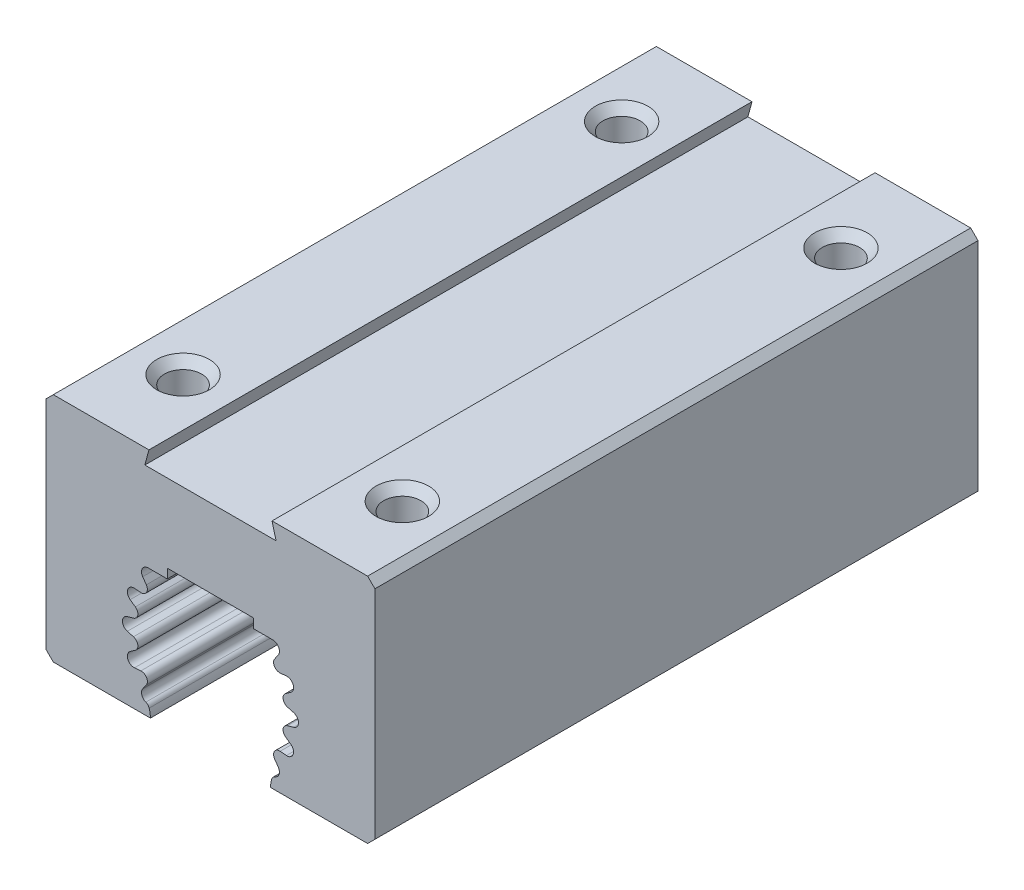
ISO-10303-21;
HEADER;
FILE_DESCRIPTION(('STEP AP214'),'2;1');
FILE_NAME('part.step','',(''),(''),'','','');
FILE_SCHEMA(('AUTOMOTIVE_DESIGN { 1 0 10303 214 1 1 1 1 }'));
ENDSEC;
DATA;
#1=APPLICATION_CONTEXT('core data for automotive mechanical design processes');
#2=APPLICATION_PROTOCOL_DEFINITION('international standard','automotive_design',2000,#1);
#3=PRODUCT_CONTEXT('',#1,'mechanical');
#4=PRODUCT('Part','Part','',(#3));
#5=PRODUCT_RELATED_PRODUCT_CATEGORY('part','',(#4));
#6=PRODUCT_DEFINITION_FORMATION('','',#4);
#7=PRODUCT_DEFINITION_CONTEXT('part definition',#1,'design');
#8=PRODUCT_DEFINITION('design','',#6,#7);
#9=PRODUCT_DEFINITION_SHAPE('','',#8);
#10=(LENGTH_UNIT() NAMED_UNIT(*) SI_UNIT(.MILLI.,.METRE.));
#11=(NAMED_UNIT(*) PLANE_ANGLE_UNIT() SI_UNIT($,.RADIAN.));
#12=(NAMED_UNIT(*) SI_UNIT($,.STERADIAN.) SOLID_ANGLE_UNIT());
#13=UNCERTAINTY_MEASURE_WITH_UNIT(LENGTH_MEASURE(1.E-05),#10,'distance_accuracy_value','');
#14=(GEOMETRIC_REPRESENTATION_CONTEXT(3) GLOBAL_UNCERTAINTY_ASSIGNED_CONTEXT((#13)) GLOBAL_UNIT_ASSIGNED_CONTEXT((#10,
#11,#12)) REPRESENTATION_CONTEXT('',''));
#15=CARTESIAN_POINT('',(0.,0.,0.));
#16=DIRECTION('',(0.,0.,1.));
#17=DIRECTION('',(1.,0.,0.));
#18=AXIS2_PLACEMENT_3D('',#15,#16,#17);
#19=CARTESIAN_POINT('',(-4.71424000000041,1.21076759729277E-09,0.));
#20=DIRECTION('',(0.,0.,1.));
#21=DIRECTION('',(1.,0.,0.));
#22=AXIS2_PLACEMENT_3D('',#19,#20,#21);
#23=CYLINDRICAL_SURFACE('',#22,0.382693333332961);
#24=DIRECTION('',(0.,0.,1.));
#25=VECTOR('',#24,1.);
#26=CARTESIAN_POINT('',(-4.81533186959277,-0.369099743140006,0.));
#27=LINE('',#26,#25);
#28=CARTESIAN_POINT('',(-4.81533186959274,-0.369099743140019,0.));
#29=VERTEX_POINT('',#28);
#30=CARTESIAN_POINT('',(-4.81533186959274,-0.369099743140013,34.925));
#31=VERTEX_POINT('',#30);
#32=EDGE_CURVE('E386',#29,#31,#27,.T.);
#33=ORIENTED_EDGE('',*,*,#32,.F.);
#34=CARTESIAN_POINT('',(-4.71424000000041,1.21076759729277E-09,0.));
#35=DIRECTION('',(0.,0.,1.));
#36=DIRECTION('',(1.,0.,0.));
#37=AXIS2_PLACEMENT_3D('',#34,#35,#36);
#38=CIRCLE('',#37,0.382693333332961);
#39=CARTESIAN_POINT('',(-4.81533186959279,0.369099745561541,0.));
#40=VERTEX_POINT('',#39);
#41=EDGE_CURVE('E20',#40,#29,#38,.T.);
#42=ORIENTED_EDGE('',*,*,#41,.F.);
#43=DIRECTION('',(0.,0.,1.));
#44=VECTOR('',#43,1.);
#45=CARTESIAN_POINT('',(-4.81533186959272,0.369099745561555,0.));
#46=LINE('',#45,#44);
#47=CARTESIAN_POINT('',(-4.81533186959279,0.369099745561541,34.925));
#48=VERTEX_POINT('',#47);
#49=EDGE_CURVE('E383',#48,#40,#46,.F.);
#50=ORIENTED_EDGE('',*,*,#49,.F.);
#51=CARTESIAN_POINT('',(-4.71424000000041,1.21076759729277E-09,34.925));
#52=DIRECTION('',(0.,0.,1.));
#53=DIRECTION('',(1.,0.,0.));
#54=AXIS2_PLACEMENT_3D('',#51,#52,#53);
#55=CIRCLE('',#54,0.382693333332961);
#56=EDGE_CURVE('E388',#31,#48,#55,.F.);
#57=ORIENTED_EDGE('',*,*,#56,.F.);
#58=EDGE_LOOP('',(#33,#42,#50,#57));
#59=FACE_BOUND('',#58,.T.);
#60=ADVANCED_FACE('F16',(#59),#23,.F.);
#61=CARTESIAN_POINT('',(4.7142334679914,-4.23593707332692E-06,0.));
#62=DIRECTION('',(0.,0.,1.));
#63=DIRECTION('',(1.,0.,0.));
#64=AXIS2_PLACEMENT_3D('',#61,#62,#63);
#65=CYLINDRICAL_SURFACE('',#64,0.382693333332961);
#66=DIRECTION('',(0.,0.,1.));
#67=VECTOR('',#66,1.);
#68=CARTESIAN_POINT('',(4.81532604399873,0.369095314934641,0.));
#69=LINE('',#68,#67);
#70=CARTESIAN_POINT('',(4.81532604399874,0.369095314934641,0.));
#71=VERTEX_POINT('',#70);
#72=CARTESIAN_POINT('',(4.81532604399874,0.369095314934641,34.925));
#73=VERTEX_POINT('',#72);
#74=EDGE_CURVE('E406',#71,#73,#69,.T.);
#75=ORIENTED_EDGE('',*,*,#74,.F.);
#76=CARTESIAN_POINT('',(4.7142334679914,-4.23593707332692E-06,0.));
#77=DIRECTION('',(0.,0.,1.));
#78=DIRECTION('',(1.,0.,0.));
#79=AXIS2_PLACEMENT_3D('',#76,#77,#78);
#80=CIRCLE('',#79,0.382693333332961);
#81=CARTESIAN_POINT('',(4.81532463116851,-0.369104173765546,0.));
#82=VERTEX_POINT('',#81);
#83=EDGE_CURVE('E575',#82,#71,#80,.T.);
#84=ORIENTED_EDGE('',*,*,#83,.F.);
#85=DIRECTION('',(0.,0.,1.));
#86=VECTOR('',#85,1.);
#87=CARTESIAN_POINT('',(4.81532463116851,-0.369104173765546,0.));
#88=LINE('',#87,#86);
#89=CARTESIAN_POINT('',(4.81532463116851,-0.369104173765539,34.925));
#90=VERTEX_POINT('',#89);
#91=EDGE_CURVE('E587',#90,#82,#88,.F.);
#92=ORIENTED_EDGE('',*,*,#91,.F.);
#93=CARTESIAN_POINT('',(4.7142334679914,-4.23593706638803E-06,34.925));
#94=DIRECTION('',(0.,0.,1.));
#95=DIRECTION('',(1.,0.,0.));
#96=AXIS2_PLACEMENT_3D('',#93,#94,#95);
#97=CIRCLE('',#96,0.382693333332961);
#98=EDGE_CURVE('E572',#73,#90,#97,.F.);
#99=ORIENTED_EDGE('',*,*,#98,.F.);
#100=EDGE_LOOP('',(#75,#84,#92,#99));
#101=FACE_BOUND('',#100,.T.);
#102=ADVANCED_FACE('F706',(#101),#65,.F.);
#103=CARTESIAN_POINT('',(-4.81533186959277,-0.369099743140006,0.));
#104=DIRECTION('',(0.264158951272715,0.964479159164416,0.));
#105=DIRECTION('',(-0.964479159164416,0.264158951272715,0.));
#106=AXIS2_PLACEMENT_3D('',#103,#104,#105);
#107=PLANE('',#106);
#108=DIRECTION('',(-0.964479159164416,0.264158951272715,0.));
#109=VECTOR('',#108,1.);
#110=CARTESIAN_POINT('',(-4.81533186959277,-0.369099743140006,0.));
#111=LINE('',#110,#109);
#112=CARTESIAN_POINT('',(-4.46042359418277,-0.466304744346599,0.));
#113=VERTEX_POINT('',#112);
#114=EDGE_CURVE('E409',#113,#29,#111,.T.);
#115=ORIENTED_EDGE('',*,*,#114,.T.);
#116=ORIENTED_EDGE('',*,*,#32,.T.);
#117=DIRECTION('',(-0.964479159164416,0.264158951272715,0.));
#118=VECTOR('',#117,1.);
#119=CARTESIAN_POINT('',(-4.81533186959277,-0.369099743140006,34.925));
#120=LINE('',#119,#118);
#121=CARTESIAN_POINT('',(-4.46042359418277,-0.466304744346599,34.925));
#122=VERTEX_POINT('',#121);
#123=EDGE_CURVE('E574',#31,#122,#120,.F.);
#124=ORIENTED_EDGE('',*,*,#123,.T.);
#125=DIRECTION('',(0.,0.,1.));
#126=VECTOR('',#125,1.);
#127=CARTESIAN_POINT('',(-4.4604235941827,-0.46630474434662,0.));
#128=LINE('',#127,#126);
#129=EDGE_CURVE('E564',#113,#122,#128,.T.);
#130=ORIENTED_EDGE('',*,*,#129,.F.);
#131=EDGE_LOOP('',(#115,#116,#124,#130));
#132=FACE_BOUND('',#131,.T.);
#133=ADVANCED_FACE('F581',(#132),#107,.T.);
#134=CARTESIAN_POINT('',(-4.46042359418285,0.466304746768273,0.));
#135=DIRECTION('',(0.264158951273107,-0.964479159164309,0.));
#136=DIRECTION('',(0.964479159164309,0.264158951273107,0.));
#137=AXIS2_PLACEMENT_3D('',#134,#135,#136);
#138=PLANE('',#137);
#139=DIRECTION('',(0.964479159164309,0.264158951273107,0.));
#140=VECTOR('',#139,1.);
#141=CARTESIAN_POINT('',(-4.46042359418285,0.466304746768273,0.));
#142=LINE('',#141,#140);
#143=CARTESIAN_POINT('',(-4.46042359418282,0.466304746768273,0.));
#144=VERTEX_POINT('',#143);
#145=EDGE_CURVE('E390',#40,#144,#142,.T.);
#146=ORIENTED_EDGE('',*,*,#145,.T.);
#147=DIRECTION('',(0.,0.,1.));
#148=VECTOR('',#147,1.);
#149=CARTESIAN_POINT('',(-4.46042359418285,0.466304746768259,0.));
#150=LINE('',#149,#148);
#151=CARTESIAN_POINT('',(-4.46042359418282,0.46630474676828,34.925));
#152=VERTEX_POINT('',#151);
#153=EDGE_CURVE('E560',#152,#144,#150,.F.);
#154=ORIENTED_EDGE('',*,*,#153,.F.);
#155=DIRECTION('',(0.964479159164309,0.264158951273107,0.));
#156=VECTOR('',#155,1.);
#157=CARTESIAN_POINT('',(-4.46042359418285,0.466304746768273,34.925));
#158=LINE('',#157,#156);
#159=EDGE_CURVE('E401',#152,#48,#158,.F.);
#160=ORIENTED_EDGE('',*,*,#159,.T.);
#161=ORIENTED_EDGE('',*,*,#49,.T.);
#162=EDGE_LOOP('',(#146,#154,#160,#161));
#163=FACE_BOUND('',#162,.T.);
#164=ADVANCED_FACE('F400',(#163),#138,.T.);
#165=CARTESIAN_POINT('',(4.81532604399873,0.369095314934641,0.));
#166=DIRECTION('',(-0.264160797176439,-0.964478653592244,0.));
#167=DIRECTION('',(0.964478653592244,-0.264160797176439,0.));
#168=AXIS2_PLACEMENT_3D('',#165,#166,#167);
#169=PLANE('',#168);
#170=DIRECTION('',(0.964478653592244,-0.264160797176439,0.));
#171=VECTOR('',#170,1.);
#172=CARTESIAN_POINT('',(4.81532604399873,0.369095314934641,0.));
#173=LINE('',#172,#171);
#174=CARTESIAN_POINT('',(4.46041795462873,0.466300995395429,0.));
#175=VERTEX_POINT('',#174);
#176=EDGE_CURVE('E597',#175,#71,#173,.T.);
#177=ORIENTED_EDGE('',*,*,#176,.T.);
#178=ORIENTED_EDGE('',*,*,#74,.T.);
#179=DIRECTION('',(0.964478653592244,-0.264160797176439,0.));
#180=VECTOR('',#179,1.);
#181=CARTESIAN_POINT('',(4.81532604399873,0.369095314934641,34.925));
#182=LINE('',#181,#180);
#183=CARTESIAN_POINT('',(4.46041795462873,0.466300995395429,34.925));
#184=VERTEX_POINT('',#183);
#185=EDGE_CURVE('E398',#73,#184,#182,.F.);
#186=ORIENTED_EDGE('',*,*,#185,.T.);
#187=DIRECTION('',(0.,0.,1.));
#188=VECTOR('',#187,1.);
#189=CARTESIAN_POINT('',(4.46041795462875,0.466300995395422,0.));
#190=LINE('',#189,#188);
#191=EDGE_CURVE('E552',#175,#184,#190,.T.);
#192=ORIENTED_EDGE('',*,*,#191,.F.);
#193=EDGE_LOOP('',(#177,#178,#186,#192));
#194=FACE_BOUND('',#193,.T.);
#195=ADVANCED_FACE('F710',(#194),#169,.T.);
#196=CARTESIAN_POINT('',(4.46041616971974,-0.466308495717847,0.));
#197=DIRECTION('',(-0.264157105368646,0.964479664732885,0.));
#198=DIRECTION('',(-0.964479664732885,-0.264157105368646,0.));
#199=AXIS2_PLACEMENT_3D('',#196,#197,#198);
#200=PLANE('',#199);
#201=DIRECTION('',(-0.964479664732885,-0.264157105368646,0.));
#202=VECTOR('',#201,1.);
#203=CARTESIAN_POINT('',(4.46041616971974,-0.466308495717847,0.));
#204=LINE('',#203,#202);
#205=CARTESIAN_POINT('',(4.46041616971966,-0.466308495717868,0.));
#206=VERTEX_POINT('',#205);
#207=EDGE_CURVE('E571',#82,#206,#204,.T.);
#208=ORIENTED_EDGE('',*,*,#207,.T.);
#209=DIRECTION('',(0.,0.,1.));
#210=VECTOR('',#209,1.);
#211=CARTESIAN_POINT('',(4.46041616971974,-0.46630849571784,0.));
#212=LINE('',#211,#210);
#213=CARTESIAN_POINT('',(4.46041616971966,-0.466308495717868,34.925));
#214=VERTEX_POINT('',#213);
#215=EDGE_CURVE('E548',#214,#206,#212,.F.);
#216=ORIENTED_EDGE('',*,*,#215,.F.);
#217=DIRECTION('',(-0.964479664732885,-0.264157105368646,0.));
#218=VECTOR('',#217,1.);
#219=CARTESIAN_POINT('',(4.46041616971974,-0.466308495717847,34.925));
#220=LINE('',#219,#218);
#221=EDGE_CURVE('E589',#214,#90,#220,.F.);
#222=ORIENTED_EDGE('',*,*,#221,.T.);
#223=ORIENTED_EDGE('',*,*,#91,.T.);
#224=EDGE_LOOP('',(#208,#216,#222,#223));
#225=FACE_BOUND('',#224,.T.);
#226=ADVANCED_FACE('F695',(#225),#200,.T.);
#227=CARTESIAN_POINT('',(-4.55256928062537,-0.802740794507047,0.));
#228=DIRECTION('',(0.,0.,1.));
#229=DIRECTION('',(1.,0.,0.));
#230=AXIS2_PLACEMENT_3D('',#227,#228,#229);
#231=CYLINDRICAL_SURFACE('',#230,0.348826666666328);
#232=CARTESIAN_POINT('',(-4.55256928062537,-0.802740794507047,0.));
#233=DIRECTION('',(0.,0.,1.));
#234=DIRECTION('',(1.,0.,0.));
#235=AXIS2_PLACEMENT_3D('',#232,#233,#234);
#236=CIRCLE('',#235,0.348826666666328);
#237=CARTESIAN_POINT('',(-4.35091275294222,-1.08737158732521,0.));
#238=VERTEX_POINT('',#237);
#239=EDGE_CURVE('E565',#238,#113,#236,.T.);
#240=ORIENTED_EDGE('',*,*,#239,.T.);
#241=ORIENTED_EDGE('',*,*,#129,.T.);
#242=CARTESIAN_POINT('',(-4.55256928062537,-0.802740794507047,34.925));
#243=DIRECTION('',(0.,0.,1.));
#244=DIRECTION('',(1.,0.,0.));
#245=AXIS2_PLACEMENT_3D('',#242,#243,#244);
#246=CIRCLE('',#245,0.348826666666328);
#247=CARTESIAN_POINT('',(-4.35091275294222,-1.08737158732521,34.925));
#248=VERTEX_POINT('',#247);
#249=EDGE_CURVE('E568',#122,#248,#246,.F.);
#250=ORIENTED_EDGE('',*,*,#249,.T.);
#251=DIRECTION('',(0.,0.,1.));
#252=VECTOR('',#251,1.);
#253=CARTESIAN_POINT('',(-4.35091275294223,-1.08737158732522,0.));
#254=LINE('',#253,#252);
#255=EDGE_CURVE('E617',#238,#248,#254,.T.);
#256=ORIENTED_EDGE('',*,*,#255,.F.);
#257=EDGE_LOOP('',(#240,#241,#250,#256));
#258=FACE_BOUND('',#257,.T.);
#259=ADVANCED_FACE('F1168',(#258),#231,.T.);
#260=CARTESIAN_POINT('',(-4.55256928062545,0.802740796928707,0.));
#261=DIRECTION('',(0.,0.,1.));
#262=DIRECTION('',(1.,0.,0.));
#263=AXIS2_PLACEMENT_3D('',#260,#261,#262);
#264=CYLINDRICAL_SURFACE('',#263,0.348826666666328);
#265=CARTESIAN_POINT('',(-4.55256928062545,0.802740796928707,0.));
#266=DIRECTION('',(0.,0.,1.));
#267=DIRECTION('',(1.,0.,0.));
#268=AXIS2_PLACEMENT_3D('',#265,#266,#267);
#269=CIRCLE('',#268,0.348826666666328);
#270=CARTESIAN_POINT('',(-4.35091275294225,1.08737158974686,0.));
#271=VERTEX_POINT('',#270);
#272=EDGE_CURVE('E394',#144,#271,#269,.T.);
#273=ORIENTED_EDGE('',*,*,#272,.T.);
#274=DIRECTION('',(0.,0.,1.));
#275=VECTOR('',#274,1.);
#276=CARTESIAN_POINT('',(-4.35091275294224,1.08737158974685,0.));
#277=LINE('',#276,#275);
#278=CARTESIAN_POINT('',(-4.35091275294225,1.08737158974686,34.925));
#279=VERTEX_POINT('',#278);
#280=EDGE_CURVE('E610',#279,#271,#277,.F.);
#281=ORIENTED_EDGE('',*,*,#280,.F.);
#282=CARTESIAN_POINT('',(-4.55256928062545,0.802740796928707,34.925));
#283=DIRECTION('',(0.,0.,1.));
#284=DIRECTION('',(1.,0.,0.));
#285=AXIS2_PLACEMENT_3D('',#282,#283,#284);
#286=CIRCLE('',#285,0.348826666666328);
#287=EDGE_CURVE('E561',#279,#152,#286,.F.);
#288=ORIENTED_EDGE('',*,*,#287,.T.);
#289=ORIENTED_EDGE('',*,*,#153,.T.);
#290=EDGE_LOOP('',(#273,#281,#288,#289));
#291=FACE_BOUND('',#290,.T.);
#292=ADVANCED_FACE('F607',(#291),#264,.T.);
#293=CARTESIAN_POINT('',(4.55256428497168,0.802736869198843,0.));
#294=DIRECTION('',(0.,0.,1.));
#295=DIRECTION('',(1.,0.,0.));
#296=AXIS2_PLACEMENT_3D('',#293,#294,#295);
#297=CYLINDRICAL_SURFACE('',#296,0.348826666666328);
#298=CARTESIAN_POINT('',(4.55256428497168,0.802736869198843,0.));
#299=DIRECTION('',(0.,0.,1.));
#300=DIRECTION('',(1.,0.,0.));
#301=AXIS2_PLACEMENT_3D('',#298,#299,#300);
#302=CIRCLE('',#301,0.348826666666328);
#303=CARTESIAN_POINT('',(4.35090830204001,1.08736804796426,0.));
#304=VERTEX_POINT('',#303);
#305=EDGE_CURVE('E553',#304,#175,#302,.T.);
#306=ORIENTED_EDGE('',*,*,#305,.T.);
#307=ORIENTED_EDGE('',*,*,#191,.T.);
#308=CARTESIAN_POINT('',(4.55256428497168,0.802736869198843,34.925));
#309=DIRECTION('',(0.,0.,1.));
#310=DIRECTION('',(1.,0.,0.));
#311=AXIS2_PLACEMENT_3D('',#308,#309,#310);
#312=CIRCLE('',#311,0.348826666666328);
#313=CARTESIAN_POINT('',(4.35090830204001,1.08736804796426,34.925));
#314=VERTEX_POINT('',#313);
#315=EDGE_CURVE('E556',#184,#314,#312,.F.);
#316=ORIENTED_EDGE('',*,*,#315,.T.);
#317=DIRECTION('',(0.,0.,1.));
#318=VECTOR('',#317,1.);
#319=CARTESIAN_POINT('',(4.35090830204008,1.0873680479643,0.));
#320=LINE('',#319,#318);
#321=EDGE_CURVE('E665',#304,#314,#320,.T.);
#322=ORIENTED_EDGE('',*,*,#321,.F.);
#323=EDGE_LOOP('',(#306,#307,#316,#322));
#324=FACE_BOUND('',#323,.T.);
#325=ADVANCED_FACE('F712',(#324),#297,.T.);
#326=CARTESIAN_POINT('',(4.55256121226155,-0.802744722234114,0.));
#327=DIRECTION('',(0.,0.,1.));
#328=DIRECTION('',(1.,0.,0.));
#329=AXIS2_PLACEMENT_3D('',#326,#327,#328);
#330=CYLINDRICAL_SURFACE('',#329,0.348826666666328);
#331=CARTESIAN_POINT('',(4.55256121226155,-0.802744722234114,0.));
#332=DIRECTION('',(0.,0.,1.));
#333=DIRECTION('',(1.,0.,0.));
#334=AXIS2_PLACEMENT_3D('',#331,#332,#333);
#335=CIRCLE('',#334,0.348826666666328);
#336=CARTESIAN_POINT('',(4.35090413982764,-1.08737512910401,0.));
#337=VERTEX_POINT('',#336);
#338=EDGE_CURVE('E545',#206,#337,#335,.T.);
#339=ORIENTED_EDGE('',*,*,#338,.T.);
#340=DIRECTION('',(0.,0.,1.));
#341=VECTOR('',#340,1.);
#342=CARTESIAN_POINT('',(4.35090413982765,-1.08737512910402,0.));
#343=LINE('',#342,#341);
#344=CARTESIAN_POINT('',(4.35090413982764,-1.08737512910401,34.925));
#345=VERTEX_POINT('',#344);
#346=EDGE_CURVE('E664',#345,#337,#343,.F.);
#347=ORIENTED_EDGE('',*,*,#346,.F.);
#348=CARTESIAN_POINT('',(4.55256121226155,-0.802744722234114,34.925));
#349=DIRECTION('',(0.,0.,1.));
#350=DIRECTION('',(1.,0.,0.));
#351=AXIS2_PLACEMENT_3D('',#348,#349,#350);
#352=CIRCLE('',#351,0.348826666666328);
#353=EDGE_CURVE('E549',#345,#214,#352,.F.);
#354=ORIENTED_EDGE('',*,*,#353,.T.);
#355=ORIENTED_EDGE('',*,*,#215,.T.);
#356=EDGE_LOOP('',(#339,#347,#354,#355));
#357=FACE_BOUND('',#356,.T.);
#358=ADVANCED_FACE('F691',(#357),#330,.T.);
#359=CARTESIAN_POINT('',(-4.35091275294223,-1.08737158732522,0.));
#360=DIRECTION('',(0.57809951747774,-0.815966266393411,0.));
#361=DIRECTION('',(0.815966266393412,0.57809951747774,0.));
#362=AXIS2_PLACEMENT_3D('',#359,#360,#361);
#363=PLANE('',#362);
#364=DIRECTION('',(0.815966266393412,0.57809951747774,0.));
#365=VECTOR('',#364,1.);
#366=CARTESIAN_POINT('',(-4.35091275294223,-1.08737158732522,0.));
#367=LINE('',#366,#365);
#368=CARTESIAN_POINT('',(-4.65117137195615,-1.30010018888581,0.));
#369=VERTEX_POINT('',#368);
#370=EDGE_CURVE('E680',#369,#238,#367,.T.);
#371=ORIENTED_EDGE('',*,*,#370,.T.);
#372=ORIENTED_EDGE('',*,*,#255,.T.);
#373=DIRECTION('',(0.815966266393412,0.57809951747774,0.));
#374=VECTOR('',#373,1.);
#375=CARTESIAN_POINT('',(-4.35091275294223,-1.08737158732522,34.925));
#376=LINE('',#375,#374);
#377=CARTESIAN_POINT('',(-4.65117137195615,-1.3001001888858,34.925));
#378=VERTEX_POINT('',#377);
#379=EDGE_CURVE('E547',#248,#378,#376,.F.);
#380=ORIENTED_EDGE('',*,*,#379,.T.);
#381=DIRECTION('',(0.,0.,1.));
#382=VECTOR('',#381,1.);
#383=CARTESIAN_POINT('',(-4.65117137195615,-1.30010018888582,0.));
#384=LINE('',#383,#382);
#385=EDGE_CURVE('E544',#378,#369,#384,.F.);
#386=ORIENTED_EDGE('',*,*,#385,.T.);
#387=EDGE_LOOP('',(#371,#372,#380,#386));
#388=FACE_BOUND('',#387,.T.);
#389=ADVANCED_FACE('F1169',(#388),#363,.T.);
#390=CARTESIAN_POINT('',(-4.65117137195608,1.30010019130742,0.));
#391=DIRECTION('',(0.578099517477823,0.815966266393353,0.));
#392=DIRECTION('',(-0.815966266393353,0.578099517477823,0.));
#393=AXIS2_PLACEMENT_3D('',#390,#391,#392);
#394=PLANE('',#393);
#395=DIRECTION('',(-0.815966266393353,0.578099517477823,0.));
#396=VECTOR('',#395,1.);
#397=CARTESIAN_POINT('',(-4.65117137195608,1.30010019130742,0.));
#398=LINE('',#397,#396);
#399=CARTESIAN_POINT('',(-4.65117137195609,1.30010019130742,0.));
#400=VERTEX_POINT('',#399);
#401=EDGE_CURVE('E622',#271,#400,#398,.T.);
#402=ORIENTED_EDGE('',*,*,#401,.T.);
#403=DIRECTION('',(0.,0.,1.));
#404=VECTOR('',#403,1.);
#405=CARTESIAN_POINT('',(-4.65117137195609,1.30010019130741,0.));
#406=LINE('',#405,#404);
#407=CARTESIAN_POINT('',(-4.65117137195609,1.30010019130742,34.925));
#408=VERTEX_POINT('',#407);
#409=EDGE_CURVE('E536',#400,#408,#406,.T.);
#410=ORIENTED_EDGE('',*,*,#409,.T.);
#411=DIRECTION('',(-0.815966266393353,0.578099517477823,0.));
#412=VECTOR('',#411,1.);
#413=CARTESIAN_POINT('',(-4.65117137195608,1.30010019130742,34.925));
#414=LINE('',#413,#412);
#415=EDGE_CURVE('E612',#408,#279,#414,.F.);
#416=ORIENTED_EDGE('',*,*,#415,.T.);
#417=ORIENTED_EDGE('',*,*,#280,.T.);
#418=EDGE_LOOP('',(#402,#410,#416,#417));
#419=FACE_BOUND('',#418,.T.);
#420=ADVANCED_FACE('F621',(#419),#394,.T.);
#421=CARTESIAN_POINT('',(4.35090830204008,1.0873680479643,0.));
#422=DIRECTION('',(-0.578097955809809,0.815967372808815,0.));
#423=DIRECTION('',(-0.815967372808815,-0.578097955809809,0.));
#424=AXIS2_PLACEMENT_3D('',#421,#422,#423);
#425=PLANE('',#424);
#426=DIRECTION('',(-0.815967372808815,-0.578097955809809,0.));
#427=VECTOR('',#426,1.);
#428=CARTESIAN_POINT('',(4.35090830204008,1.0873680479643,0.));
#429=LINE('',#428,#427);
#430=CARTESIAN_POINT('',(4.65116732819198,1.30009607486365,0.));
#431=VERTEX_POINT('',#430);
#432=EDGE_CURVE('E673',#431,#304,#429,.T.);
#433=ORIENTED_EDGE('',*,*,#432,.T.);
#434=ORIENTED_EDGE('',*,*,#321,.T.);
#435=DIRECTION('',(-0.815967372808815,-0.578097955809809,0.));
#436=VECTOR('',#435,1.);
#437=CARTESIAN_POINT('',(4.35090830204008,1.0873680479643,34.925));
#438=LINE('',#437,#436);
#439=CARTESIAN_POINT('',(4.65116732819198,1.30009607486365,34.925));
#440=VERTEX_POINT('',#439);
#441=EDGE_CURVE('E671',#314,#440,#438,.F.);
#442=ORIENTED_EDGE('',*,*,#441,.T.);
#443=DIRECTION('',(0.,0.,1.));
#444=VECTOR('',#443,1.);
#445=CARTESIAN_POINT('',(4.65116732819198,1.30009607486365,0.));
#446=LINE('',#445,#444);
#447=EDGE_CURVE('E533',#440,#431,#446,.F.);
#448=ORIENTED_EDGE('',*,*,#447,.T.);
#449=EDGE_LOOP('',(#433,#434,#442,#448));
#450=FACE_BOUND('',#449,.T.);
#451=ADVANCED_FACE('F714',(#450),#425,.T.);
#452=CARTESIAN_POINT('',(4.65116235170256,-1.30010430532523,0.));
#453=DIRECTION('',(-0.578101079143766,-0.815965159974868,0.));
#454=DIRECTION('',(0.815965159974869,-0.578101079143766,0.));
#455=AXIS2_PLACEMENT_3D('',#452,#453,#454);
#456=PLANE('',#455);
#457=DIRECTION('',(0.815965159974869,-0.578101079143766,0.));
#458=VECTOR('',#457,1.);
#459=CARTESIAN_POINT('',(4.65116235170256,-1.30010430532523,0.));
#460=LINE('',#459,#458);
#461=CARTESIAN_POINT('',(4.65116235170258,-1.30010430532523,0.));
#462=VERTEX_POINT('',#461);
#463=EDGE_CURVE('E666',#337,#462,#460,.T.);
#464=ORIENTED_EDGE('',*,*,#463,.T.);
#465=DIRECTION('',(0.,0.,1.));
#466=VECTOR('',#465,1.);
#467=CARTESIAN_POINT('',(4.65116235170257,-1.30010430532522,0.));
#468=LINE('',#467,#466);
#469=CARTESIAN_POINT('',(4.65116235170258,-1.30010430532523,34.925));
#470=VERTEX_POINT('',#469);
#471=EDGE_CURVE('E525',#462,#470,#468,.T.);
#472=ORIENTED_EDGE('',*,*,#471,.T.);
#473=DIRECTION('',(0.815965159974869,-0.578101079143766,0.));
#474=VECTOR('',#473,1.);
#475=CARTESIAN_POINT('',(4.65116235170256,-1.30010430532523,34.925));
#476=LINE('',#475,#474);
#477=EDGE_CURVE('E661',#470,#345,#476,.F.);
#478=ORIENTED_EDGE('',*,*,#477,.T.);
#479=ORIENTED_EDGE('',*,*,#346,.T.);
#480=EDGE_LOOP('',(#464,#472,#478,#479));
#481=FACE_BOUND('',#480,.T.);
#482=ADVANCED_FACE('F700',(#481),#456,.T.);
#483=CARTESIAN_POINT('',(-4.42993654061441,-1.61236503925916,0.));
#484=DIRECTION('',(0.,0.,1.));
#485=DIRECTION('',(1.,0.,0.));
#486=AXIS2_PLACEMENT_3D('',#483,#484,#485);
#487=CYLINDRICAL_SURFACE('',#486,0.382693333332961);
#488=DIRECTION('',(0.,0.,1.));
#489=VECTOR('',#488,1.);
#490=CARTESIAN_POINT('',(-4.39869227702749,-1.99378080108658,0.));
#491=LINE('',#490,#489);
#492=CARTESIAN_POINT('',(-4.39869227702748,-1.99378080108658,0.));
#493=VERTEX_POINT('',#492);
#494=CARTESIAN_POINT('',(-4.39869227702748,-1.99378080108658,34.925));
#495=VERTEX_POINT('',#494);
#496=EDGE_CURVE('E637',#493,#495,#491,.T.);
#497=ORIENTED_EDGE('',*,*,#496,.F.);
#498=CARTESIAN_POINT('',(-4.42993654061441,-1.61236503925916,0.));
#499=DIRECTION('',(0.,0.,1.));
#500=DIRECTION('',(1.,0.,0.));
#501=AXIS2_PLACEMENT_3D('',#498,#499,#500);
#502=CIRCLE('',#501,0.382693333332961);
#503=EDGE_CURVE('E542',#369,#493,#502,.T.);
#504=ORIENTED_EDGE('',*,*,#503,.F.);
#505=ORIENTED_EDGE('',*,*,#385,.F.);
#506=CARTESIAN_POINT('',(-4.42993654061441,-1.61236503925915,34.925));
#507=DIRECTION('',(0.,0.,1.));
#508=DIRECTION('',(1.,0.,0.));
#509=AXIS2_PLACEMENT_3D('',#506,#507,#508);
#510=CIRCLE('',#509,0.382693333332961);
#511=EDGE_CURVE('E539',#495,#378,#510,.F.);
#512=ORIENTED_EDGE('',*,*,#511,.F.);
#513=EDGE_LOOP('',(#497,#504,#505,#512));
#514=FACE_BOUND('',#513,.T.);
#515=ADVANCED_FACE('F1163',(#514),#487,.F.);
#516=CARTESIAN_POINT('',(-4.42993654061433,1.61236504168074,0.));
#517=DIRECTION('',(0.,0.,1.));
#518=DIRECTION('',(1.,0.,0.));
#519=AXIS2_PLACEMENT_3D('',#516,#517,#518);
#520=CYLINDRICAL_SURFACE('',#519,0.382693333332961);
#521=ORIENTED_EDGE('',*,*,#409,.F.);
#522=CARTESIAN_POINT('',(-4.42993654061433,1.61236504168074,0.));
#523=DIRECTION('',(0.,0.,1.));
#524=DIRECTION('',(1.,0.,0.));
#525=AXIS2_PLACEMENT_3D('',#522,#523,#524);
#526=CIRCLE('',#525,0.382693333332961);
#527=CARTESIAN_POINT('',(-4.39869227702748,1.99378080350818,0.));
#528=VERTEX_POINT('',#527);
#529=EDGE_CURVE('E537',#528,#400,#526,.T.);
#530=ORIENTED_EDGE('',*,*,#529,.F.);
#531=DIRECTION('',(0.,0.,1.));
#532=VECTOR('',#531,1.);
#533=CARTESIAN_POINT('',(-4.39869227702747,1.99378080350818,0.));
#534=LINE('',#533,#532);
#535=CARTESIAN_POINT('',(-4.39869227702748,1.99378080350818,34.925));
#536=VERTEX_POINT('',#535);
#537=EDGE_CURVE('E627',#536,#528,#534,.F.);
#538=ORIENTED_EDGE('',*,*,#537,.F.);
#539=CARTESIAN_POINT('',(-4.42993654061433,1.61236504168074,34.925));
#540=DIRECTION('',(0.,0.,1.));
#541=DIRECTION('',(1.,0.,0.));
#542=AXIS2_PLACEMENT_3D('',#539,#540,#541);
#543=CIRCLE('',#542,0.382693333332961);
#544=EDGE_CURVE('E534',#408,#536,#543,.F.);
#545=ORIENTED_EDGE('',*,*,#544,.F.);
#546=EDGE_LOOP('',(#521,#530,#538,#545));
#547=FACE_BOUND('',#546,.T.);
#548=ADVANCED_FACE('F625',(#547),#520,.F.);
#549=CARTESIAN_POINT('',(4.42993309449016,1.6123613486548,0.));
#550=DIRECTION('',(0.,0.,1.));
#551=DIRECTION('',(1.,0.,0.));
#552=AXIS2_PLACEMENT_3D('',#549,#550,#551);
#553=CYLINDRICAL_SURFACE('',#552,0.382693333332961);
#554=DIRECTION('',(0.,0.,1.));
#555=VECTOR('',#554,1.);
#556=CARTESIAN_POINT('',(4.39868956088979,1.99377717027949,0.));
#557=LINE('',#556,#555);
#558=CARTESIAN_POINT('',(4.39868956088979,1.99377717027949,0.));
#559=VERTEX_POINT('',#558);
#560=CARTESIAN_POINT('',(4.39868956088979,1.99377717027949,34.925));
#561=VERTEX_POINT('',#560);
#562=EDGE_CURVE('E655',#559,#561,#557,.T.);
#563=ORIENTED_EDGE('',*,*,#562,.F.);
#564=CARTESIAN_POINT('',(4.42993309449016,1.6123613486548,0.));
#565=DIRECTION('',(0.,0.,1.));
#566=DIRECTION('',(1.,0.,0.));
#567=AXIS2_PLACEMENT_3D('',#564,#565,#566);
#568=CIRCLE('',#567,0.382693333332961);
#569=EDGE_CURVE('E531',#431,#559,#568,.T.);
#570=ORIENTED_EDGE('',*,*,#569,.F.);
#571=ORIENTED_EDGE('',*,*,#447,.F.);
#572=CARTESIAN_POINT('',(4.42993309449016,1.6123613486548,34.925));
#573=DIRECTION('',(0.,0.,1.));
#574=DIRECTION('',(1.,0.,0.));
#575=AXIS2_PLACEMENT_3D('',#572,#573,#574);
#576=CIRCLE('',#575,0.382693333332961);
#577=EDGE_CURVE('E528',#561,#440,#576,.F.);
#578=ORIENTED_EDGE('',*,*,#577,.F.);
#579=EDGE_LOOP('',(#563,#570,#571,#578));
#580=FACE_BOUND('',#579,.T.);
#581=ADVANCED_FACE('F722',(#580),#553,.F.);
#582=CARTESIAN_POINT('',(4.42992692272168,-1.61236873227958,0.));
#583=DIRECTION('',(0.,0.,1.));
#584=DIRECTION('',(1.,0.,0.));
#585=AXIS2_PLACEMENT_3D('',#582,#583,#584);
#586=CYLINDRICAL_SURFACE('',#585,0.382693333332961);
#587=ORIENTED_EDGE('',*,*,#471,.F.);
#588=CARTESIAN_POINT('',(4.42992692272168,-1.61236873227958,0.));
#589=DIRECTION('',(0.,0.,1.));
#590=DIRECTION('',(1.,0.,0.));
#591=AXIS2_PLACEMENT_3D('',#588,#589,#590);
#592=CIRCLE('',#591,0.382693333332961);
#593=CARTESIAN_POINT('',(4.39868192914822,-1.99378443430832,0.));
#594=VERTEX_POINT('',#593);
#595=EDGE_CURVE('E526',#594,#462,#592,.T.);
#596=ORIENTED_EDGE('',*,*,#595,.F.);
#597=DIRECTION('',(0.,0.,1.));
#598=VECTOR('',#597,1.);
#599=CARTESIAN_POINT('',(4.39868192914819,-1.99378443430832,0.));
#600=LINE('',#599,#598);
#601=CARTESIAN_POINT('',(4.39868192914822,-1.99378443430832,34.925));
#602=VERTEX_POINT('',#601);
#603=EDGE_CURVE('E651',#602,#594,#600,.F.);
#604=ORIENTED_EDGE('',*,*,#603,.F.);
#605=CARTESIAN_POINT('',(4.42992692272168,-1.61236873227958,34.925));
#606=DIRECTION('',(0.,0.,1.));
#607=DIRECTION('',(1.,0.,0.));
#608=AXIS2_PLACEMENT_3D('',#605,#606,#607);
#609=CIRCLE('',#608,0.382693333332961);
#610=EDGE_CURVE('E522',#470,#602,#609,.F.);
#611=ORIENTED_EDGE('',*,*,#610,.F.);
#612=EDGE_LOOP('',(#587,#596,#604,#611));
#613=FACE_BOUND('',#612,.T.);
#614=ADVANCED_FACE('F1505',(#613),#586,.F.);
#615=CARTESIAN_POINT('',(-4.39869227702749,-1.99378080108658,0.));
#616=DIRECTION('',(-0.081643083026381,0.996661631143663,0.));
#617=DIRECTION('',(-0.996661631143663,-0.081643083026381,0.));
#618=AXIS2_PLACEMENT_3D('',#615,#616,#617);
#619=PLANE('',#618);
#620=DIRECTION('',(-0.996661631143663,-0.081643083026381,0.));
#621=VECTOR('',#620,1.);
#622=CARTESIAN_POINT('',(-4.39869227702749,-1.99378080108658,0.));
#623=LINE('',#622,#621);
#624=CARTESIAN_POINT('',(-4.03194152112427,-1.96373784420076,0.));
#625=VERTEX_POINT('',#624);
#626=EDGE_CURVE('E640',#625,#493,#623,.T.);
#627=ORIENTED_EDGE('',*,*,#626,.T.);
#628=ORIENTED_EDGE('',*,*,#496,.T.);
#629=DIRECTION('',(-0.996661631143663,-0.081643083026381,0.));
#630=VECTOR('',#629,1.);
#631=CARTESIAN_POINT('',(-4.39869227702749,-1.99378080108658,34.925));
#632=LINE('',#631,#630);
#633=CARTESIAN_POINT('',(-4.03194152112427,-1.96373784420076,34.925));
#634=VERTEX_POINT('',#633);
#635=EDGE_CURVE('E524',#495,#634,#632,.F.);
#636=ORIENTED_EDGE('',*,*,#635,.T.);
#637=DIRECTION('',(0.,0.,1.));
#638=VECTOR('',#637,1.);
#639=CARTESIAN_POINT('',(-4.03194152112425,-1.96373784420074,0.));
#640=LINE('',#639,#638);
#641=EDGE_CURVE('E514',#625,#634,#640,.T.);
#642=ORIENTED_EDGE('',*,*,#641,.F.);
#643=EDGE_LOOP('',(#627,#628,#636,#642));
#644=FACE_BOUND('',#643,.T.);
#645=ADVANCED_FACE('F1159',(#644),#619,.T.);
#646=CARTESIAN_POINT('',(-4.0319415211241,1.96373784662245,0.));
#647=DIRECTION('',(-0.081643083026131,-0.996661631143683,0.));
#648=DIRECTION('',(0.996661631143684,-0.0816430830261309,0.));
#649=AXIS2_PLACEMENT_3D('',#646,#647,#648);
#650=PLANE('',#649);
#651=DIRECTION('',(0.996661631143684,-0.0816430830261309,0.));
#652=VECTOR('',#651,1.);
#653=CARTESIAN_POINT('',(-4.0319415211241,1.96373784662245,0.));
#654=LINE('',#653,#652);
#655=CARTESIAN_POINT('',(-4.03194152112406,1.96373784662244,0.));
#656=VERTEX_POINT('',#655);
#657=EDGE_CURVE('E631',#528,#656,#654,.T.);
#658=ORIENTED_EDGE('',*,*,#657,.T.);
#659=DIRECTION('',(0.,0.,1.));
#660=VECTOR('',#659,1.);
#661=CARTESIAN_POINT('',(-4.0319415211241,1.96373784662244,0.));
#662=LINE('',#661,#660);
#663=CARTESIAN_POINT('',(-4.03194152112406,1.96373784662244,34.925));
#664=VERTEX_POINT('',#663);
#665=EDGE_CURVE('E510',#664,#656,#662,.F.);
#666=ORIENTED_EDGE('',*,*,#665,.F.);
#667=DIRECTION('',(0.996661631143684,-0.0816430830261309,0.));
#668=VECTOR('',#667,1.);
#669=CARTESIAN_POINT('',(-4.0319415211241,1.96373784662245,34.925));
#670=LINE('',#669,#668);
#671=EDGE_CURVE('E632',#664,#536,#670,.F.);
#672=ORIENTED_EDGE('',*,*,#671,.T.);
#673=ORIENTED_EDGE('',*,*,#537,.T.);
#674=EDGE_LOOP('',(#658,#666,#672,#673));
#675=FACE_BOUND('',#674,.T.);
#676=ADVANCED_FACE('F635',(#675),#650,.T.);
#677=CARTESIAN_POINT('',(4.39868956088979,1.99377717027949,0.));
#678=DIRECTION('',(0.081641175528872,-0.996661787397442,0.));
#679=DIRECTION('',(0.996661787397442,0.0816411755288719,0.));
#680=AXIS2_PLACEMENT_3D('',#677,#678,#679);
#681=PLANE('',#680);
#682=DIRECTION('',(0.996661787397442,0.0816411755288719,0.));
#683=VECTOR('',#682,1.);
#684=CARTESIAN_POINT('',(4.39868956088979,1.99377717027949,0.));
#685=LINE('',#684,#683);
#686=CARTESIAN_POINT('',(4.0319387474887,1.96373491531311,0.));
#687=VERTEX_POINT('',#686);
#688=EDGE_CURVE('E657',#687,#559,#685,.T.);
#689=ORIENTED_EDGE('',*,*,#688,.T.);
#690=ORIENTED_EDGE('',*,*,#562,.T.);
#691=DIRECTION('',(0.996661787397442,0.0816411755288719,0.));
#692=VECTOR('',#691,1.);
#693=CARTESIAN_POINT('',(4.39868956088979,1.99377717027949,34.925));
#694=LINE('',#693,#692);
#695=CARTESIAN_POINT('',(4.0319387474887,1.96373491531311,34.925));
#696=VERTEX_POINT('',#695);
#697=EDGE_CURVE('E727',#561,#696,#694,.F.);
#698=ORIENTED_EDGE('',*,*,#697,.T.);
#699=DIRECTION('',(0.,0.,1.));
#700=VECTOR('',#699,1.);
#701=CARTESIAN_POINT('',(4.0319387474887,1.9637349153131,0.));
#702=LINE('',#701,#700);
#703=EDGE_CURVE('E501',#687,#696,#702,.T.);
#704=ORIENTED_EDGE('',*,*,#703,.F.);
#705=EDGE_LOOP('',(#689,#690,#698,#704));
#706=FACE_BOUND('',#705,.T.);
#707=ADVANCED_FACE('F725',(#706),#681,.T.);
#708=CARTESIAN_POINT('',(4.03193123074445,-1.96374077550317,0.));
#709=DIRECTION('',(0.081644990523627,0.99666147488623,0.));
#710=DIRECTION('',(-0.996661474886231,0.0816449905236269,0.));
#711=AXIS2_PLACEMENT_3D('',#708,#709,#710);
#712=PLANE('',#711);
#713=DIRECTION('',(-0.996661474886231,0.0816449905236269,0.));
#714=VECTOR('',#713,1.);
#715=CARTESIAN_POINT('',(4.03193123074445,-1.96374077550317,0.));
#716=LINE('',#715,#714);
#717=CARTESIAN_POINT('',(4.03193123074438,-1.96374077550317,0.));
#718=VERTEX_POINT('',#717);
#719=EDGE_CURVE('E521',#594,#718,#716,.T.);
#720=ORIENTED_EDGE('',*,*,#719,.T.);
#721=DIRECTION('',(0.,0.,1.));
#722=VECTOR('',#721,1.);
#723=CARTESIAN_POINT('',(4.03193123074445,-1.96374077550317,0.));
#724=LINE('',#723,#722);
#725=CARTESIAN_POINT('',(4.03193123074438,-1.96374077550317,34.925));
#726=VERTEX_POINT('',#725);
#727=EDGE_CURVE('E497',#726,#718,#724,.F.);
#728=ORIENTED_EDGE('',*,*,#727,.F.);
#729=DIRECTION('',(-0.996661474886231,0.0816449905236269,0.));
#730=VECTOR('',#729,1.);
#731=CARTESIAN_POINT('',(4.03193123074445,-1.96374077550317,34.925));
#732=LINE('',#731,#730);
#733=EDGE_CURVE('E654',#726,#602,#732,.F.);
#734=ORIENTED_EDGE('',*,*,#733,.T.);
#735=ORIENTED_EDGE('',*,*,#603,.T.);
#736=EDGE_LOOP('',(#720,#728,#734,#735));
#737=FACE_BOUND('',#736,.T.);
#738=ADVANCED_FACE('F820',(#737),#712,.T.);
#739=CARTESIAN_POINT('',(-4.00346223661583,-2.31139999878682,0.));
#740=DIRECTION('',(0.,0.,1.));
#741=DIRECTION('',(1.,0.,0.));
#742=AXIS2_PLACEMENT_3D('',#739,#740,#741);
#743=CYLINDRICAL_SURFACE('',#742,0.348826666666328);
#744=CARTESIAN_POINT('',(-4.00346223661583,-2.31139999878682,0.));
#745=DIRECTION('',(0.,0.,1.));
#746=DIRECTION('',(1.,0.,0.));
#747=AXIS2_PLACEMENT_3D('',#744,#745,#746);
#748=CIRCLE('',#747,0.348826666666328);
#749=CARTESIAN_POINT('',(-3.71661762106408,-2.50989485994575,0.));
#750=VERTEX_POINT('',#749);
#751=EDGE_CURVE('E515',#750,#625,#748,.T.);
#752=ORIENTED_EDGE('',*,*,#751,.T.);
#753=ORIENTED_EDGE('',*,*,#641,.T.);
#754=CARTESIAN_POINT('',(-4.00346223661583,-2.31139999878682,34.925));
#755=DIRECTION('',(0.,0.,1.));
#756=DIRECTION('',(1.,0.,0.));
#757=AXIS2_PLACEMENT_3D('',#754,#755,#756);
#758=CIRCLE('',#757,0.348826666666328);
#759=CARTESIAN_POINT('',(-3.71661762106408,-2.50989485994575,34.925));
#760=VERTEX_POINT('',#759);
#761=EDGE_CURVE('E518',#634,#760,#758,.F.);
#762=ORIENTED_EDGE('',*,*,#761,.T.);
#763=DIRECTION('',(0.,0.,1.));
#764=VECTOR('',#763,1.);
#765=CARTESIAN_POINT('',(-3.71661762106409,-2.50989485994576,0.));
#766=LINE('',#765,#764);
#767=EDGE_CURVE('E745',#750,#760,#766,.T.);
#768=ORIENTED_EDGE('',*,*,#767,.F.);
#769=EDGE_LOOP('',(#752,#753,#762,#768));
#770=FACE_BOUND('',#769,.T.);
#771=ADVANCED_FACE('F1042',(#770),#743,.T.);
#772=CARTESIAN_POINT('',(-4.00346223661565,2.3114000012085,0.));
#773=DIRECTION('',(0.,0.,1.));
#774=DIRECTION('',(1.,0.,0.));
#775=AXIS2_PLACEMENT_3D('',#772,#773,#774);
#776=CYLINDRICAL_SURFACE('',#775,0.348826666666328);
#777=CARTESIAN_POINT('',(-4.00346223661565,2.3114000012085,0.));
#778=DIRECTION('',(0.,0.,1.));
#779=DIRECTION('',(1.,0.,0.));
#780=AXIS2_PLACEMENT_3D('',#777,#778,#779);
#781=CIRCLE('',#780,0.348826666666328);
#782=CARTESIAN_POINT('',(-3.71661762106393,2.50989486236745,0.));
#783=VERTEX_POINT('',#782);
#784=EDGE_CURVE('E508',#656,#783,#781,.T.);
#785=ORIENTED_EDGE('',*,*,#784,.T.);
#786=DIRECTION('',(0.,0.,1.));
#787=VECTOR('',#786,1.);
#788=CARTESIAN_POINT('',(-3.71661762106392,2.50989486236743,0.));
#789=LINE('',#788,#787);
#790=CARTESIAN_POINT('',(-3.71661762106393,2.50989486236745,34.925));
#791=VERTEX_POINT('',#790);
#792=EDGE_CURVE('E738',#791,#783,#789,.F.);
#793=ORIENTED_EDGE('',*,*,#792,.F.);
#794=CARTESIAN_POINT('',(-4.00346223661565,2.31140000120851,34.925));
#795=DIRECTION('',(0.,0.,1.));
#796=DIRECTION('',(1.,0.,0.));
#797=AXIS2_PLACEMENT_3D('',#794,#795,#796);
#798=CIRCLE('',#797,0.348826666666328);
#799=EDGE_CURVE('E511',#791,#664,#798,.F.);
#800=ORIENTED_EDGE('',*,*,#799,.T.);
#801=ORIENTED_EDGE('',*,*,#665,.T.);
#802=EDGE_LOOP('',(#785,#793,#800,#801));
#803=FACE_BOUND('',#802,.T.);
#804=ADVANCED_FACE('F733',(#803),#776,.T.);
#805=CARTESIAN_POINT('',(4.00346012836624,2.31139712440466,0.));
#806=DIRECTION('',(0.,0.,1.));
#807=DIRECTION('',(1.,0.,0.));
#808=AXIS2_PLACEMENT_3D('',#805,#806,#807);
#809=CYLINDRICAL_SURFACE('',#808,0.348826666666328);
#810=CARTESIAN_POINT('',(4.00346012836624,2.31139712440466,0.));
#811=DIRECTION('',(0.,0.,1.));
#812=DIRECTION('',(1.,0.,0.));
#813=AXIS2_PLACEMENT_3D('',#810,#811,#812);
#814=CIRCLE('',#813,0.348826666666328);
#815=CARTESIAN_POINT('',(3.71661589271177,2.50989253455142,0.));
#816=VERTEX_POINT('',#815);
#817=EDGE_CURVE('E502',#816,#687,#814,.T.);
#818=ORIENTED_EDGE('',*,*,#817,.T.);
#819=ORIENTED_EDGE('',*,*,#703,.T.);
#820=CARTESIAN_POINT('',(4.00346012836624,2.31139712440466,34.925));
#821=DIRECTION('',(0.,0.,1.));
#822=DIRECTION('',(1.,0.,0.));
#823=AXIS2_PLACEMENT_3D('',#820,#821,#822);
#824=CIRCLE('',#823,0.348826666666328);
#825=CARTESIAN_POINT('',(3.71661589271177,2.50989253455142,34.925));
#826=VERTEX_POINT('',#825);
#827=EDGE_CURVE('E505',#696,#826,#824,.F.);
#828=ORIENTED_EDGE('',*,*,#827,.T.);
#829=DIRECTION('',(0.,0.,1.));
#830=VECTOR('',#829,1.);
#831=CARTESIAN_POINT('',(3.71661589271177,2.50989253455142,0.));
#832=LINE('',#831,#830);
#833=EDGE_CURVE('E790',#816,#826,#832,.T.);
#834=ORIENTED_EDGE('',*,*,#833,.F.);
#835=EDGE_LOOP('',(#818,#819,#828,#834));
#836=FACE_BOUND('',#835,.T.);
#837=ADVANCED_FACE('F1032',(#836),#809,.T.);
#838=CARTESIAN_POINT('',(4.00345128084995,-2.31140287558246,0.));
#839=DIRECTION('',(0.,0.,1.));
#840=DIRECTION('',(1.,0.,0.));
#841=AXIS2_PLACEMENT_3D('',#838,#839,#840);
#842=CYLINDRICAL_SURFACE('',#841,0.348826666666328);
#843=CARTESIAN_POINT('',(4.00345128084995,-2.31140287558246,0.));
#844=DIRECTION('',(0.,0.,1.));
#845=DIRECTION('',(1.,0.,0.));
#846=AXIS2_PLACEMENT_3D('',#843,#844,#845);
#847=CIRCLE('',#846,0.348826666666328);
#848=CARTESIAN_POINT('',(3.71660628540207,-2.50989718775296,0.));
#849=VERTEX_POINT('',#848);
#850=EDGE_CURVE('E494',#718,#849,#847,.T.);
#851=ORIENTED_EDGE('',*,*,#850,.T.);
#852=DIRECTION('',(0.,0.,1.));
#853=VECTOR('',#852,1.);
#854=CARTESIAN_POINT('',(3.71660628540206,-2.50989718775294,0.));
#855=LINE('',#854,#853);
#856=CARTESIAN_POINT('',(3.71660628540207,-2.50989718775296,34.925));
#857=VERTEX_POINT('',#856);
#858=EDGE_CURVE('E789',#857,#849,#855,.F.);
#859=ORIENTED_EDGE('',*,*,#858,.F.);
#860=CARTESIAN_POINT('',(4.00345128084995,-2.31140287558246,34.925));
#861=DIRECTION('',(0.,0.,1.));
#862=DIRECTION('',(1.,0.,0.));
#863=AXIS2_PLACEMENT_3D('',#860,#861,#862);
#864=CIRCLE('',#863,0.348826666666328);
#865=EDGE_CURVE('E498',#857,#726,#864,.F.);
#866=ORIENTED_EDGE('',*,*,#865,.T.);
#867=ORIENTED_EDGE('',*,*,#727,.T.);
#868=EDGE_LOOP('',(#851,#859,#866,#867));
#869=FACE_BOUND('',#868,.T.);
#870=ADVANCED_FACE('F823',(#869),#842,.T.);
#871=CARTESIAN_POINT('',(-3.71661762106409,-2.50989485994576,0.));
#872=DIRECTION('',(0.822312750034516,-0.569035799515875,0.));
#873=DIRECTION('',(0.569035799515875,0.822312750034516,0.));
#874=AXIS2_PLACEMENT_3D('',#871,#872,#873);
#875=PLANE('',#874);
#876=DIRECTION('',(0.569035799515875,0.822312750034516,0.));
#877=VECTOR('',#876,1.);
#878=CARTESIAN_POINT('',(-3.71661762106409,-2.50989485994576,0.));
#879=LINE('',#878,#877);
#880=CARTESIAN_POINT('',(-3.92601096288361,-2.81248885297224,0.));
#881=VERTEX_POINT('',#880);
#882=EDGE_CURVE('E805',#881,#750,#879,.T.);
#883=ORIENTED_EDGE('',*,*,#882,.T.);
#884=ORIENTED_EDGE('',*,*,#767,.T.);
#885=DIRECTION('',(0.569035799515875,0.822312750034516,0.));
#886=VECTOR('',#885,1.);
#887=CARTESIAN_POINT('',(-3.71661762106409,-2.50989485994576,34.925));
#888=LINE('',#887,#886);
#889=CARTESIAN_POINT('',(-3.92601096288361,-2.81248885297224,34.925));
#890=VERTEX_POINT('',#889);
#891=EDGE_CURVE('E496',#760,#890,#888,.F.);
#892=ORIENTED_EDGE('',*,*,#891,.T.);
#893=DIRECTION('',(0.,0.,1.));
#894=VECTOR('',#893,1.);
#895=CARTESIAN_POINT('',(-3.92601096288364,-2.81248885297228,0.));
#896=LINE('',#895,#894);
#897=EDGE_CURVE('E493',#890,#881,#896,.F.);
#898=ORIENTED_EDGE('',*,*,#897,.T.);
#899=EDGE_LOOP('',(#883,#884,#892,#898));
#900=FACE_BOUND('',#899,.T.);
#901=ADVANCED_FACE('F1040',(#900),#875,.T.);
#902=CARTESIAN_POINT('',(-3.9260109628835,2.8124888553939,0.));
#903=DIRECTION('',(0.82231275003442,0.569035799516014,0.));
#904=DIRECTION('',(-0.569035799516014,0.82231275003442,0.));
#905=AXIS2_PLACEMENT_3D('',#902,#903,#904);
#906=PLANE('',#905);
#907=DIRECTION('',(-0.569035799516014,0.82231275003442,0.));
#908=VECTOR('',#907,1.);
#909=CARTESIAN_POINT('',(-3.9260109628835,2.8124888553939,0.));
#910=LINE('',#909,#908);
#911=CARTESIAN_POINT('',(-3.92601096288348,2.81248885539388,0.));
#912=VERTEX_POINT('',#911);
#913=EDGE_CURVE('E750',#783,#912,#910,.T.);
#914=ORIENTED_EDGE('',*,*,#913,.T.);
#915=DIRECTION('',(0.,0.,1.));
#916=VECTOR('',#915,1.);
#917=CARTESIAN_POINT('',(-3.9260109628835,2.8124888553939,0.));
#918=LINE('',#917,#916);
#919=CARTESIAN_POINT('',(-3.92601096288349,2.81248885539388,34.925));
#920=VERTEX_POINT('',#919);
#921=EDGE_CURVE('E485',#912,#920,#918,.T.);
#922=ORIENTED_EDGE('',*,*,#921,.T.);
#923=DIRECTION('',(-0.569035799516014,0.82231275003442,0.));
#924=VECTOR('',#923,1.);
#925=CARTESIAN_POINT('',(-3.9260109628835,2.8124888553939,34.925));
#926=LINE('',#925,#924);
#927=EDGE_CURVE('E740',#920,#791,#926,.F.);
#928=ORIENTED_EDGE('',*,*,#927,.T.);
#929=ORIENTED_EDGE('',*,*,#792,.T.);
#930=EDGE_LOOP('',(#914,#922,#928,#929));
#931=FACE_BOUND('',#930,.T.);
#932=ADVANCED_FACE('F749',(#931),#906,.T.);
#933=CARTESIAN_POINT('',(3.71661589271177,2.50989253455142,0.));
#934=DIRECTION('',(-0.822311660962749,0.569037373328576,0.));
#935=DIRECTION('',(-0.569037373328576,-0.822311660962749,0.));
#936=AXIS2_PLACEMENT_3D('',#933,#934,#935);
#937=PLANE('',#936);
#938=DIRECTION('',(-0.569037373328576,-0.822311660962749,0.));
#939=VECTOR('',#938,1.);
#940=CARTESIAN_POINT('',(3.71661589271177,2.50989253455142,0.));
#941=LINE('',#940,#939);
#942=CARTESIAN_POINT('',(3.92600981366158,2.81248612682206,0.));
#943=VERTEX_POINT('',#942);
#944=EDGE_CURVE('E798',#943,#816,#941,.T.);
#945=ORIENTED_EDGE('',*,*,#944,.T.);
#946=ORIENTED_EDGE('',*,*,#833,.T.);
#947=DIRECTION('',(-0.569037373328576,-0.822311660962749,0.));
#948=VECTOR('',#947,1.);
#949=CARTESIAN_POINT('',(3.71661589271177,2.50989253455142,34.925));
#950=LINE('',#949,#948);
#951=CARTESIAN_POINT('',(3.92600981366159,2.81248612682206,34.925));
#952=VERTEX_POINT('',#951);
#953=EDGE_CURVE('E796',#826,#952,#950,.F.);
#954=ORIENTED_EDGE('',*,*,#953,.T.);
#955=DIRECTION('',(0.,0.,1.));
#956=VECTOR('',#955,1.);
#957=CARTESIAN_POINT('',(3.92600981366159,2.81248612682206,0.));
#958=LINE('',#957,#956);
#959=EDGE_CURVE('E482',#952,#943,#958,.F.);
#960=ORIENTED_EDGE('',*,*,#959,.T.);
#961=EDGE_LOOP('',(#945,#946,#954,#960));
#962=FACE_BOUND('',#961,.T.);
#963=ADVANCED_FACE('F1029',(#962),#937,.T.);
#964=CARTESIAN_POINT('',(3.92599904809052,-2.81249158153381,0.));
#965=DIRECTION('',(-0.822313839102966,-0.569034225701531,0.));
#966=DIRECTION('',(0.569034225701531,-0.822313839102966,0.));
#967=AXIS2_PLACEMENT_3D('',#964,#965,#966);
#968=PLANE('',#967);
#969=DIRECTION('',(0.569034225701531,-0.822313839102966,0.));
#970=VECTOR('',#969,1.);
#971=CARTESIAN_POINT('',(3.92599904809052,-2.81249158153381,0.));
#972=LINE('',#971,#970);
#973=CARTESIAN_POINT('',(3.92599904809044,-2.81249158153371,0.));
#974=VERTEX_POINT('',#973);
#975=EDGE_CURVE('E791',#849,#974,#972,.T.);
#976=ORIENTED_EDGE('',*,*,#975,.T.);
#977=DIRECTION('',(0.,0.,1.));
#978=VECTOR('',#977,1.);
#979=CARTESIAN_POINT('',(3.92599904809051,-2.81249158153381,0.));
#980=LINE('',#979,#978);
#981=CARTESIAN_POINT('',(3.92599904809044,-2.81249158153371,34.925));
#982=VERTEX_POINT('',#981);
#983=EDGE_CURVE('E474',#974,#982,#980,.T.);
#984=ORIENTED_EDGE('',*,*,#983,.T.);
#985=DIRECTION('',(0.569034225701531,-0.822313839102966,0.));
#986=VECTOR('',#985,1.);
#987=CARTESIAN_POINT('',(3.92599904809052,-2.81249158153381,34.925));
#988=LINE('',#987,#986);
#989=EDGE_CURVE('E786',#982,#857,#988,.F.);
#990=ORIENTED_EDGE('',*,*,#989,.T.);
#991=ORIENTED_EDGE('',*,*,#858,.T.);
#992=EDGE_LOOP('',(#976,#984,#990,#991));
#993=FACE_BOUND('',#992,.T.);
#994=ADVANCED_FACE('F827',(#993),#968,.T.);
#995=CARTESIAN_POINT('',(-3.61131735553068,-3.03025505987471,0.));
#996=DIRECTION('',(0.,0.,1.));
#997=DIRECTION('',(1.,0.,0.));
#998=AXIS2_PLACEMENT_3D('',#995,#996,#997);
#999=CYLINDRICAL_SURFACE('',#998,0.382693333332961);
#1000=DIRECTION('',(0.,0.,1.));
#1001=VECTOR('',#1000,1.);
#1002=CARTESIAN_POINT('',(-3.74525568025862,-3.38874454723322,0.));
#1003=LINE('',#1002,#1001);
#1004=CARTESIAN_POINT('',(-3.74525568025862,-3.38874454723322,0.));
#1005=VERTEX_POINT('',#1004);
#1006=CARTESIAN_POINT('',(-3.74525568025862,-3.38874454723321,34.925));
#1007=VERTEX_POINT('',#1006);
#1008=EDGE_CURVE('E468',#1005,#1007,#1003,.T.);
#1009=ORIENTED_EDGE('',*,*,#1008,.F.);
#1010=CARTESIAN_POINT('',(-3.61131735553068,-3.03025505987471,0.));
#1011=DIRECTION('',(0.,0.,1.));
#1012=DIRECTION('',(1.,0.,0.));
#1013=AXIS2_PLACEMENT_3D('',#1010,#1011,#1012);
#1014=CIRCLE('',#1013,0.382693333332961);
#1015=EDGE_CURVE('E491',#881,#1005,#1014,.T.);
#1016=ORIENTED_EDGE('',*,*,#1015,.F.);
#1017=ORIENTED_EDGE('',*,*,#897,.F.);
#1018=CARTESIAN_POINT('',(-3.61131735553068,-3.03025505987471,34.925));
#1019=DIRECTION('',(0.,0.,1.));
#1020=DIRECTION('',(1.,0.,0.));
#1021=AXIS2_PLACEMENT_3D('',#1018,#1019,#1020);
#1022=CIRCLE('',#1021,0.382693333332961);
#1023=EDGE_CURVE('E488',#1007,#890,#1022,.F.);
#1024=ORIENTED_EDGE('',*,*,#1023,.F.);
#1025=EDGE_LOOP('',(#1009,#1016,#1017,#1024));
#1026=FACE_BOUND('',#1025,.T.);
#1027=ADVANCED_FACE('F1137',(#1026),#999,.F.);
#1028=CARTESIAN_POINT('',(-3.6113173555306,3.03025506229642,0.));
#1029=DIRECTION('',(0.,0.,1.));
#1030=DIRECTION('',(1.,0.,0.));
#1031=AXIS2_PLACEMENT_3D('',#1028,#1029,#1030);
#1032=CYLINDRICAL_SURFACE('',#1031,0.382693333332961);
#1033=ORIENTED_EDGE('',*,*,#921,.F.);
#1034=CARTESIAN_POINT('',(-3.6113173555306,3.03025506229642,0.));
#1035=DIRECTION('',(0.,0.,1.));
#1036=DIRECTION('',(1.,0.,0.));
#1037=AXIS2_PLACEMENT_3D('',#1034,#1035,#1036);
#1038=CIRCLE('',#1037,0.382693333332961);
#1039=CARTESIAN_POINT('',(-3.6113173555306,3.41294839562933,0.));
#1040=VERTEX_POINT('',#1039);
#1041=EDGE_CURVE('E486',#1040,#912,#1038,.T.);
#1042=ORIENTED_EDGE('',*,*,#1041,.F.);
#1043=DIRECTION('',(0.,0.,-1.));
#1044=VECTOR('',#1043,1.);
#1045=CARTESIAN_POINT('',(-3.6113173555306,3.41294839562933,0.));
#1046=LINE('',#1045,#1044);
#1047=CARTESIAN_POINT('',(-3.6113173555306,3.41294839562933,34.925));
#1048=VERTEX_POINT('',#1047);
#1049=EDGE_CURVE('E755',#1048,#1040,#1046,.T.);
#1050=ORIENTED_EDGE('',*,*,#1049,.F.);
#1051=CARTESIAN_POINT('',(-3.6113173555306,3.03025506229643,34.925));
#1052=DIRECTION('',(0.,0.,1.));
#1053=DIRECTION('',(1.,0.,0.));
#1054=AXIS2_PLACEMENT_3D('',#1051,#1052,#1053);
#1055=CIRCLE('',#1054,0.382693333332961);
#1056=EDGE_CURVE('E483',#920,#1048,#1055,.F.);
#1057=ORIENTED_EDGE('',*,*,#1056,.F.);
#1058=EDGE_LOOP('',(#1033,#1042,#1050,#1057));
#1059=FACE_BOUND('',#1058,.T.);
#1060=ADVANCED_FACE('F753',(#1059),#1032,.F.);
#1061=CARTESIAN_POINT('',(3.61131662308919,3.03025293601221,0.));
#1062=DIRECTION('',(0.,0.,1.));
#1063=DIRECTION('',(1.,0.,0.));
#1064=AXIS2_PLACEMENT_3D('',#1061,#1062,#1063);
#1065=CYLINDRICAL_SURFACE('',#1064,0.382693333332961);
#1066=DIRECTION('',(0.,0.,1.));
#1067=VECTOR('',#1066,1.);
#1068=CARTESIAN_POINT('',(3.61131735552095,3.41294626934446,0.));
#1069=LINE('',#1068,#1067);
#1070=CARTESIAN_POINT('',(3.61131735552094,3.41294626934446,0.));
#1071=VERTEX_POINT('',#1070);
#1072=CARTESIAN_POINT('',(3.61131735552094,3.41294626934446,34.925));
#1073=VERTEX_POINT('',#1072);
#1074=EDGE_CURVE('E464',#1071,#1073,#1069,.T.);
#1075=ORIENTED_EDGE('',*,*,#1074,.F.);
#1076=CARTESIAN_POINT('',(3.61131662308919,3.03025293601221,0.));
#1077=DIRECTION('',(0.,0.,1.));
#1078=DIRECTION('',(1.,0.,0.));
#1079=AXIS2_PLACEMENT_3D('',#1076,#1077,#1078);
#1080=CIRCLE('',#1079,0.382693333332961);
#1081=EDGE_CURVE('E480',#943,#1071,#1080,.T.);
#1082=ORIENTED_EDGE('',*,*,#1081,.F.);
#1083=ORIENTED_EDGE('',*,*,#959,.F.);
#1084=CARTESIAN_POINT('',(3.61131662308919,3.03025293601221,34.925));
#1085=DIRECTION('',(0.,0.,1.));
#1086=DIRECTION('',(1.,0.,0.));
#1087=AXIS2_PLACEMENT_3D('',#1084,#1085,#1086);
#1088=CIRCLE('',#1087,0.382693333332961);
#1089=EDGE_CURVE('E477',#1073,#952,#1088,.F.);
#1090=ORIENTED_EDGE('',*,*,#1089,.F.);
#1091=EDGE_LOOP('',(#1075,#1082,#1083,#1090));
#1092=FACE_BOUND('',#1091,.T.);
#1093=ADVANCED_FACE('F1026',(#1092),#1065,.F.);
#1094=CARTESIAN_POINT('',(3.61130502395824,-3.03025718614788,0.));
#1095=DIRECTION('',(0.,0.,1.));
#1096=DIRECTION('',(1.,0.,0.));
#1097=AXIS2_PLACEMENT_3D('',#1094,#1095,#1096);
#1098=CYLINDRICAL_SURFACE('',#1097,0.382693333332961);
#1099=ORIENTED_EDGE('',*,*,#983,.F.);
#1100=CARTESIAN_POINT('',(3.61130502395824,-3.03025718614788,0.));
#1101=DIRECTION('',(0.,0.,1.));
#1102=DIRECTION('',(1.,0.,0.));
#1103=AXIS2_PLACEMENT_3D('',#1100,#1101,#1102);
#1104=CIRCLE('',#1103,0.382693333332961);
#1105=CARTESIAN_POINT('',(3.74524266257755,-3.38874692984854,0.));
#1106=VERTEX_POINT('',#1105);
#1107=EDGE_CURVE('E475',#1106,#974,#1104,.T.);
#1108=ORIENTED_EDGE('',*,*,#1107,.F.);
#1109=DIRECTION('',(0.,0.,1.));
#1110=VECTOR('',#1109,1.);
#1111=CARTESIAN_POINT('',(3.74524266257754,-3.38874692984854,0.));
#1112=LINE('',#1111,#1110);
#1113=CARTESIAN_POINT('',(3.74524266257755,-3.38874692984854,34.925));
#1114=VERTEX_POINT('',#1113);
#1115=EDGE_CURVE('E460',#1114,#1106,#1112,.F.);
#1116=ORIENTED_EDGE('',*,*,#1115,.F.);
#1117=CARTESIAN_POINT('',(3.61130502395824,-3.03025718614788,34.925));
#1118=DIRECTION('',(0.,0.,1.));
#1119=DIRECTION('',(1.,0.,0.));
#1120=AXIS2_PLACEMENT_3D('',#1117,#1118,#1119);
#1121=CIRCLE('',#1120,0.382693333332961);
#1122=EDGE_CURVE('E472',#982,#1114,#1121,.F.);
#1123=ORIENTED_EDGE('',*,*,#1122,.F.);
#1124=EDGE_LOOP('',(#1099,#1108,#1116,#1123));
#1125=FACE_BOUND('',#1124,.T.);
#1126=ADVANCED_FACE('F832',(#1125),#1098,.F.);
#1127=CARTESIAN_POINT('',(-6.35000934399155,4.65666666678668,30.1625));
#1128=DIRECTION('',(0.,1.,0.));
#1129=DIRECTION('',(0.,0.,1.));
#1130=AXIS2_PLACEMENT_3D('',#1127,#1128,#1129);
#1131=CONICAL_SURFACE('',#1130,1.0795,1.02974425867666);
#1132=CARTESIAN_POINT('',(-6.35000934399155,4.00803762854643,30.1625));
#1133=VERTEX_POINT('',#1132);
#1134=VERTEX_LOOP('',#1133);
#1135=FACE_BOUND('',#1134,.T.);
#1136=CARTESIAN_POINT('',(-6.35000934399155,4.65666666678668,30.1625));
#1137=DIRECTION('',(0.,1.,0.));
#1138=DIRECTION('',(0.,0.,1.));
#1139=AXIS2_PLACEMENT_3D('',#1136,#1137,#1138);
#1140=CIRCLE('',#1139,1.0795);
#1141=CARTESIAN_POINT('',(-6.35000934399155,4.65666666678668,29.083));
#1142=VERTEX_POINT('',#1141);
#1143=EDGE_CURVE('E459',#1142,#1142,#1140,.T.);
#1144=ORIENTED_EDGE('',*,*,#1143,.T.);
#1145=EDGE_LOOP('',(#1144));
#1146=FACE_BOUND('',#1145,.T.);
#1147=ADVANCED_FACE('F1132',(#1135,#1146),#1131,.F.);
#1148=CARTESIAN_POINT('',(-6.35000934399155,4.65666666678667,4.7625));
#1149=DIRECTION('',(0.,1.,0.));
#1150=DIRECTION('',(0.,0.,1.));
#1151=AXIS2_PLACEMENT_3D('',#1148,#1149,#1150);
#1152=CONICAL_SURFACE('',#1151,1.0795,1.02974425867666);
#1153=CARTESIAN_POINT('',(-6.35000934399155,4.00803762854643,4.7625));
#1154=VERTEX_POINT('',#1153);
#1155=VERTEX_LOOP('',#1154);
#1156=FACE_BOUND('',#1155,.T.);
#1157=CARTESIAN_POINT('',(-6.35000934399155,4.65666666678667,4.7625));
#1158=DIRECTION('',(0.,1.,0.));
#1159=DIRECTION('',(0.,0.,1.));
#1160=AXIS2_PLACEMENT_3D('',#1157,#1158,#1159);
#1161=CIRCLE('',#1160,1.0795);
#1162=CARTESIAN_POINT('',(-6.35000934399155,4.65666666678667,3.683));
#1163=VERTEX_POINT('',#1162);
#1164=EDGE_CURVE('E973',#1163,#1163,#1161,.T.);
#1165=ORIENTED_EDGE('',*,*,#1164,.T.);
#1166=EDGE_LOOP('',(#1165));
#1167=FACE_BOUND('',#1166,.T.);
#1168=ADVANCED_FACE('F1200',(#1156,#1167),#1152,.F.);
#1169=CARTESIAN_POINT('',(6.34999065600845,4.65666666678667,4.7625));
#1170=DIRECTION('',(0.,1.,0.));
#1171=DIRECTION('',(0.,0.,1.));
#1172=AXIS2_PLACEMENT_3D('',#1169,#1170,#1171);
#1173=CONICAL_SURFACE('',#1172,1.0795,1.02974425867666);
#1174=CARTESIAN_POINT('',(6.34999065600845,4.00803762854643,4.7625));
#1175=VERTEX_POINT('',#1174);
#1176=VERTEX_LOOP('',#1175);
#1177=FACE_BOUND('',#1176,.T.);
#1178=CARTESIAN_POINT('',(6.34999065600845,4.65666666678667,4.7625));
#1179=DIRECTION('',(0.,1.,0.));
#1180=DIRECTION('',(0.,0.,1.));
#1181=AXIS2_PLACEMENT_3D('',#1178,#1179,#1180);
#1182=CIRCLE('',#1181,1.0795);
#1183=CARTESIAN_POINT('',(6.34999065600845,4.65666666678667,3.683));
#1184=VERTEX_POINT('',#1183);
#1185=EDGE_CURVE('E968',#1184,#1184,#1182,.T.);
#1186=ORIENTED_EDGE('',*,*,#1185,.T.);
#1187=EDGE_LOOP('',(#1186));
#1188=FACE_BOUND('',#1187,.T.);
#1189=ADVANCED_FACE('F1204',(#1177,#1188),#1173,.F.);
#1190=CARTESIAN_POINT('',(6.34999065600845,4.65666666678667,30.1625));
#1191=DIRECTION('',(0.,1.,0.));
#1192=DIRECTION('',(0.,0.,1.));
#1193=AXIS2_PLACEMENT_3D('',#1190,#1191,#1192);
#1194=CONICAL_SURFACE('',#1193,1.0795,1.02974425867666);
#1195=CARTESIAN_POINT('',(6.34999065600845,4.00803762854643,30.1625));
#1196=VERTEX_POINT('',#1195);
#1197=VERTEX_LOOP('',#1196);
#1198=FACE_BOUND('',#1197,.T.);
#1199=CARTESIAN_POINT('',(6.34999065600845,4.65666666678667,30.1625));
#1200=DIRECTION('',(0.,1.,0.));
#1201=DIRECTION('',(0.,0.,1.));
#1202=AXIS2_PLACEMENT_3D('',#1199,#1200,#1201);
#1203=CIRCLE('',#1202,1.0795);
#1204=CARTESIAN_POINT('',(6.34999065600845,4.65666666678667,29.083));
#1205=VERTEX_POINT('',#1204);
#1206=EDGE_CURVE('E456',#1205,#1205,#1203,.T.);
#1207=ORIENTED_EDGE('',*,*,#1206,.T.);
#1208=EDGE_LOOP('',(#1207));
#1209=FACE_BOUND('',#1208,.T.);
#1210=ADVANCED_FACE('F1128',(#1198,#1209),#1194,.F.);
#1211=CARTESIAN_POINT('',(-3.85785869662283,-3.69012951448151,0.));
#1212=DIRECTION('',(0.,0.,1.));
#1213=DIRECTION('',(1.,0.,0.));
#1214=AXIS2_PLACEMENT_3D('',#1211,#1212,#1213);
#1215=CYLINDRICAL_SURFACE('',#1214,0.321733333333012);
#1216=CARTESIAN_POINT('',(-3.85785869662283,-3.69012951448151,0.));
#1217=DIRECTION('',(0.,0.,1.));
#1218=DIRECTION('',(1.,0.,0.));
#1219=AXIS2_PLACEMENT_3D('',#1216,#1217,#1218);
#1220=CIRCLE('',#1219,0.321733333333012);
#1221=CARTESIAN_POINT('',(-3.5516704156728,-3.59133136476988,0.));
#1222=VERTEX_POINT('',#1221);
#1223=EDGE_CURVE('E465',#1222,#1005,#1220,.T.);
#1224=ORIENTED_EDGE('',*,*,#1223,.T.);
#1225=ORIENTED_EDGE('',*,*,#1008,.T.);
#1226=CARTESIAN_POINT('',(-3.85785869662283,-3.69012951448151,34.925));
#1227=DIRECTION('',(0.,0.,1.));
#1228=DIRECTION('',(1.,0.,0.));
#1229=AXIS2_PLACEMENT_3D('',#1226,#1227,#1228);
#1230=CIRCLE('',#1229,0.321733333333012);
#1231=CARTESIAN_POINT('',(-3.55167041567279,-3.59133136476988,34.925));
#1232=VERTEX_POINT('',#1231);
#1233=EDGE_CURVE('E469',#1007,#1232,#1230,.F.);
#1234=ORIENTED_EDGE('',*,*,#1233,.T.);
#1235=DIRECTION('',(0.,0.,1.));
#1236=VECTOR('',#1235,1.);
#1237=CARTESIAN_POINT('',(-3.55167041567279,-3.59133136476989,0.));
#1238=LINE('',#1237,#1236);
#1239=EDGE_CURVE('E453',#1222,#1232,#1238,.T.);
#1240=ORIENTED_EDGE('',*,*,#1239,.F.);
#1241=EDGE_LOOP('',(#1224,#1225,#1234,#1240));
#1242=FACE_BOUND('',#1241,.T.);
#1243=ADVANCED_FACE('F1125',(#1242),#1215,.T.);
#1244=CARTESIAN_POINT('',(-2.50033906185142,3.41294839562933,0.));
#1245=DIRECTION('',(0.,-1.,0.));
#1246=DIRECTION('',(0.,0.,-1.));
#1247=AXIS2_PLACEMENT_3D('',#1244,#1245,#1246);
#1248=PLANE('',#1247);
#1249=DIRECTION('',(1.,0.,0.));
#1250=VECTOR('',#1249,1.);
#1251=CARTESIAN_POINT('',(-2.50033906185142,3.41294839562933,0.));
#1252=LINE('',#1251,#1250);
#1253=CARTESIAN_POINT('',(-2.50033906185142,3.41294839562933,0.));
#1254=VERTEX_POINT('',#1253);
#1255=EDGE_CURVE('E759',#1040,#1254,#1252,.T.);
#1256=ORIENTED_EDGE('',*,*,#1255,.T.);
#1257=DIRECTION('',(0.,0.,-1.));
#1258=VECTOR('',#1257,1.);
#1259=CARTESIAN_POINT('',(-2.50033906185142,3.41294839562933,0.));
#1260=LINE('',#1259,#1258);
#1261=CARTESIAN_POINT('',(-2.50033906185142,3.41294839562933,34.925));
#1262=VERTEX_POINT('',#1261);
#1263=EDGE_CURVE('E765',#1262,#1254,#1260,.T.);
#1264=ORIENTED_EDGE('',*,*,#1263,.F.);
#1265=DIRECTION('',(1.,0.,0.));
#1266=VECTOR('',#1265,1.);
#1267=CARTESIAN_POINT('',(-2.50033906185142,3.41294839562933,34.925));
#1268=LINE('',#1267,#1266);
#1269=EDGE_CURVE('E760',#1262,#1048,#1268,.F.);
#1270=ORIENTED_EDGE('',*,*,#1269,.T.);
#1271=ORIENTED_EDGE('',*,*,#1049,.T.);
#1272=EDGE_LOOP('',(#1256,#1264,#1270,#1271));
#1273=FACE_BOUND('',#1272,.T.);
#1274=ADVANCED_FACE('F763',(#1273),#1248,.T.);
#1275=CARTESIAN_POINT('',(3.61131735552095,3.41294626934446,0.));
#1276=DIRECTION('',(-1.913886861E-06,-0.999999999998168,0.));
#1277=DIRECTION('',(0.999999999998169,-1.913886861E-06,0.));
#1278=AXIS2_PLACEMENT_3D('',#1275,#1276,#1277);
#1279=PLANE('',#1278);
#1280=DIRECTION('',(0.999999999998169,-1.913886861E-06,0.));
#1281=VECTOR('',#1280,1.);
#1282=CARTESIAN_POINT('',(3.61131735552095,3.41294626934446,0.));
#1283=LINE('',#1282,#1281);
#1284=CARTESIAN_POINT('',(2.50033906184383,3.41294839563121,0.));
#1285=VERTEX_POINT('',#1284);
#1286=EDGE_CURVE('E782',#1285,#1071,#1283,.T.);
#1287=ORIENTED_EDGE('',*,*,#1286,.T.);
#1288=ORIENTED_EDGE('',*,*,#1074,.T.);
#1289=DIRECTION('',(0.999999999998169,-1.913886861E-06,0.));
#1290=VECTOR('',#1289,1.);
#1291=CARTESIAN_POINT('',(3.61131735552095,3.41294626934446,34.925));
#1292=LINE('',#1291,#1290);
#1293=CARTESIAN_POINT('',(2.50033906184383,3.41294839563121,34.925));
#1294=VERTEX_POINT('',#1293);
#1295=EDGE_CURVE('E1003',#1073,#1294,#1292,.F.);
#1296=ORIENTED_EDGE('',*,*,#1295,.T.);
#1297=DIRECTION('',(0.,0.,1.));
#1298=VECTOR('',#1297,1.);
#1299=CARTESIAN_POINT('',(2.50033906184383,3.41294839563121,0.));
#1300=LINE('',#1299,#1298);
#1301=EDGE_CURVE('E443',#1285,#1294,#1300,.T.);
#1302=ORIENTED_EDGE('',*,*,#1301,.F.);
#1303=EDGE_LOOP('',(#1287,#1288,#1296,#1302));
#1304=FACE_BOUND('',#1303,.T.);
#1305=ADVANCED_FACE('F1021',(#1304),#1279,.T.);
#1306=CARTESIAN_POINT('',(3.85784510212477,-3.69013211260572,0.));
#1307=DIRECTION('',(0.,0.,1.));
#1308=DIRECTION('',(1.,0.,0.));
#1309=AXIS2_PLACEMENT_3D('',#1306,#1307,#1308);
#1310=CYLINDRICAL_SURFACE('',#1309,0.321733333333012);
#1311=CARTESIAN_POINT('',(3.85784510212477,-3.69013211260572,0.));
#1312=DIRECTION('',(0.,0.,1.));
#1313=DIRECTION('',(1.,0.,0.));
#1314=AXIS2_PLACEMENT_3D('',#1311,#1312,#1313);
#1315=CIRCLE('',#1314,0.321733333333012);
#1316=CARTESIAN_POINT('',(3.55165701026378,-3.59133337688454,0.));
#1317=VERTEX_POINT('',#1316);
#1318=EDGE_CURVE('E457',#1106,#1317,#1315,.T.);
#1319=ORIENTED_EDGE('',*,*,#1318,.T.);
#1320=DIRECTION('',(0.,0.,1.));
#1321=VECTOR('',#1320,1.);
#1322=CARTESIAN_POINT('',(3.55165701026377,-3.59133337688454,0.));
#1323=LINE('',#1322,#1321);
#1324=CARTESIAN_POINT('',(3.55165701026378,-3.59133337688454,34.925));
#1325=VERTEX_POINT('',#1324);
#1326=EDGE_CURVE('E439',#1325,#1317,#1323,.F.);
#1327=ORIENTED_EDGE('',*,*,#1326,.F.);
#1328=CARTESIAN_POINT('',(3.85784510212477,-3.69013211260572,34.925));
#1329=DIRECTION('',(0.,0.,1.));
#1330=DIRECTION('',(1.,0.,0.));
#1331=AXIS2_PLACEMENT_3D('',#1328,#1329,#1330);
#1332=CIRCLE('',#1331,0.321733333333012);
#1333=EDGE_CURVE('E461',#1325,#1114,#1332,.F.);
#1334=ORIENTED_EDGE('',*,*,#1333,.T.);
#1335=ORIENTED_EDGE('',*,*,#1115,.T.);
#1336=EDGE_LOOP('',(#1319,#1327,#1334,#1335));
#1337=FACE_BOUND('',#1336,.T.);
#1338=ADVANCED_FACE('F837',(#1337),#1310,.T.);
#1339=CARTESIAN_POINT('',(-6.35000934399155,8.84432790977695,30.1625));
#1340=DIRECTION('',(0.,-1.,0.));
#1341=DIRECTION('',(0.,0.,-1.));
#1342=AXIS2_PLACEMENT_3D('',#1339,#1340,#1341);
#1343=CYLINDRICAL_SURFACE('',#1342,1.0795);
#1344=CARTESIAN_POINT('',(-6.35000934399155,8.84432790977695,30.1625));
#1345=DIRECTION('',(0.,1.,0.));
#1346=DIRECTION('',(0.,0.,1.));
#1347=AXIS2_PLACEMENT_3D('',#1344,#1345,#1346);
#1348=CIRCLE('',#1347,1.0795);
#1349=CARTESIAN_POINT('',(-6.35000934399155,8.84432790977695,29.083));
#1350=VERTEX_POINT('',#1349);
#1351=EDGE_CURVE('E944',#1350,#1350,#1348,.T.);
#1352=CARTESIAN_POINT('',(-6.35000934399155,4.65666666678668,29.083));
#1353=CARTESIAN_POINT('',(-6.35000934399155,4.70028813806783,29.083));
#1354=CARTESIAN_POINT('',(-6.35000934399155,4.74390960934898,29.083));
#1355=CARTESIAN_POINT('',(-6.35000934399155,4.83115255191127,29.083));
#1356=CARTESIAN_POINT('',(-6.35000934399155,4.87477402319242,29.083));
#1357=CARTESIAN_POINT('',(-6.35000934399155,4.96201696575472,29.083));
#1358=CARTESIAN_POINT('',(-6.35000934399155,5.00563843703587,29.083));
#1359=CARTESIAN_POINT('',(-6.35000934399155,5.09288137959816,29.083));
#1360=CARTESIAN_POINT('',(-6.35000934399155,5.13650285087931,29.083));
#1361=CARTESIAN_POINT('',(-6.35000934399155,5.22374579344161,29.083));
#1362=CARTESIAN_POINT('',(-6.35000934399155,5.26736726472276,29.083));
#1363=CARTESIAN_POINT('',(-6.35000934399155,5.35461020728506,29.083));
#1364=CARTESIAN_POINT('',(-6.35000934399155,5.39823167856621,29.083));
#1365=CARTESIAN_POINT('',(-6.35000934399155,5.4854746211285,29.083));
#1366=CARTESIAN_POINT('',(-6.35000934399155,5.52909609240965,29.083));
#1367=CARTESIAN_POINT('',(-6.35000934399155,5.61633903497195,29.083));
#1368=CARTESIAN_POINT('',(-6.35000934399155,5.6599605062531,29.083));
#1369=CARTESIAN_POINT('',(-6.35000934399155,5.7472034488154,29.083));
#1370=CARTESIAN_POINT('',(-6.35000934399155,5.79082492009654,29.083));
#1371=CARTESIAN_POINT('',(-6.35000934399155,5.87806786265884,29.083));
#1372=CARTESIAN_POINT('',(-6.35000934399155,5.92168933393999,29.083));
#1373=CARTESIAN_POINT('',(-6.35000934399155,6.00893227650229,29.083));
#1374=CARTESIAN_POINT('',(-6.35000934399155,6.05255374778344,29.083));
#1375=CARTESIAN_POINT('',(-6.35000934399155,6.13979669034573,29.083));
#1376=CARTESIAN_POINT('',(-6.35000934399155,6.18341816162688,29.083));
#1377=CARTESIAN_POINT('',(-6.35000934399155,6.27066110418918,29.083));
#1378=CARTESIAN_POINT('',(-6.35000934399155,6.31428257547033,29.083));
#1379=CARTESIAN_POINT('',(-6.35000934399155,6.40152551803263,29.083));
#1380=CARTESIAN_POINT('',(-6.35000934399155,6.44514698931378,29.083));
#1381=CARTESIAN_POINT('',(-6.35000934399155,6.53238993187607,29.083));
#1382=CARTESIAN_POINT('',(-6.35000934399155,6.57601140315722,29.083));
#1383=CARTESIAN_POINT('',(-6.35000934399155,6.66325434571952,29.083));
#1384=CARTESIAN_POINT('',(-6.35000934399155,6.70687581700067,29.083));
#1385=CARTESIAN_POINT('',(-6.35000934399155,6.79411875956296,29.083));
#1386=CARTESIAN_POINT('',(-6.35000934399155,6.83774023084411,29.083));
#1387=CARTESIAN_POINT('',(-6.35000934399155,6.92498317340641,29.083));
#1388=CARTESIAN_POINT('',(-6.35000934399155,6.96860464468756,29.083));
#1389=CARTESIAN_POINT('',(-6.35000934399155,7.05584758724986,29.083));
#1390=CARTESIAN_POINT('',(-6.35000934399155,7.099469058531,29.083));
#1391=CARTESIAN_POINT('',(-6.35000934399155,7.1867120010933,29.083));
#1392=CARTESIAN_POINT('',(-6.35000934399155,7.23033347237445,29.083));
#1393=CARTESIAN_POINT('',(-6.35000934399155,7.31757641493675,29.083));
#1394=CARTESIAN_POINT('',(-6.35000934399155,7.3611978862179,29.083));
#1395=CARTESIAN_POINT('',(-6.35000934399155,7.44844082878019,29.083));
#1396=CARTESIAN_POINT('',(-6.35000934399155,7.49206230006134,29.083));
#1397=CARTESIAN_POINT('',(-6.35000934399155,7.57930524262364,29.083));
#1398=CARTESIAN_POINT('',(-6.35000934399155,7.62292671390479,29.083));
#1399=CARTESIAN_POINT('',(-6.35000934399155,7.71016965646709,29.083));
#1400=CARTESIAN_POINT('',(-6.35000934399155,7.75379112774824,29.083));
#1401=CARTESIAN_POINT('',(-6.35000934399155,7.84103407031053,29.083));
#1402=CARTESIAN_POINT('',(-6.35000934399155,7.88465554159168,29.083));
#1403=CARTESIAN_POINT('',(-6.35000934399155,7.97189848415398,29.083));
#1404=CARTESIAN_POINT('',(-6.35000934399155,8.01551995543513,29.083));
#1405=CARTESIAN_POINT('',(-6.35000934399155,8.10276289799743,29.083));
#1406=CARTESIAN_POINT('',(-6.35000934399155,8.14638436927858,29.083));
#1407=CARTESIAN_POINT('',(-6.35000934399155,8.23362731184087,29.083));
#1408=CARTESIAN_POINT('',(-6.35000934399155,8.27724878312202,29.083));
#1409=CARTESIAN_POINT('',(-6.35000934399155,8.36449172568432,29.083));
#1410=CARTESIAN_POINT('',(-6.35000934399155,8.40811319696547,29.083));
#1411=CARTESIAN_POINT('',(-6.35000934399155,8.49535613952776,29.083));
#1412=CARTESIAN_POINT('',(-6.35000934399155,8.53897761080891,29.083));
#1413=CARTESIAN_POINT('',(-6.35000934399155,8.62622055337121,29.083));
#1414=CARTESIAN_POINT('',(-6.35000934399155,8.66984202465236,29.083));
#1415=CARTESIAN_POINT('',(-6.35000934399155,8.75708496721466,29.083));
#1416=CARTESIAN_POINT('',(-6.35000934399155,8.8007064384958,29.083));
#1417=CARTESIAN_POINT('',(-6.35000934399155,8.84432790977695,29.083));
#1418=B_SPLINE_CURVE_WITH_KNOTS('',3,(#1352,#1353,#1354,#1355,#1356,#1357,#1358,#1359,#1360,
#1361,#1362,#1363,#1364,#1365,#1366,#1367,#1368,#1369,#1370,#1371,#1372,#1373,#1374,#1375,#1376,
#1377,#1378,#1379,#1380,#1381,#1382,#1383,#1384,#1385,#1386,#1387,#1388,#1389,#1390,#1391,#1392,
#1393,#1394,#1395,#1396,#1397,#1398,#1399,#1400,#1401,#1402,#1403,#1404,#1405,#1406,#1407,#1408,
#1409,#1410,#1411,#1412,#1413,#1414,#1415,#1416,#1417),.UNSPECIFIED.,.F.,.F.,(4,2,2,2,2,2,2,2,2,
2,2,2,2,2,2,2,2,2,2,2,2,2,2,2,2,2,2,2,2,2,2,2,4),(0.,0.130864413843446,0.261728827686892,
0.392593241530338,0.523457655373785,0.654322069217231,0.785186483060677,0.916050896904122,
1.04691531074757,1.17777972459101,1.30864413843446,1.43950855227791,1.57037296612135,
1.7012373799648,1.83210179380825,1.96296620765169,2.09383062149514,2.22469503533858,
2.35555944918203,2.48642386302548,2.61728827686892,2.74815269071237,2.87901710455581,
3.00988151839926,3.14074593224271,3.27161034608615,3.4024747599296,3.53333917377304,
3.66420358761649,3.79506800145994,3.92593241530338,4.05679682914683,4.18766124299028),.UNSPECIFIED.);
#1419=EDGE_CURVE('BSEAM1120',#1142,#1350,#1418,.T.);
#1420=ORIENTED_EDGE('',*,*,#1143,.F.);
#1421=ORIENTED_EDGE('',*,*,#1351,.T.);
#1422=ORIENTED_EDGE('',*,*,#1419,.T.);
#1423=ORIENTED_EDGE('',*,*,#1419,.F.);
#1424=EDGE_LOOP('',(#1420,#1422,#1421,#1423));
#1425=FACE_BOUND('',#1424,.T.);
#1426=ADVANCED_FACE('F1120',(#1425),#1343,.F.);
#1427=CARTESIAN_POINT('',(-6.35000934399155,8.84432790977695,4.7625));
#1428=DIRECTION('',(0.,-1.,0.));
#1429=DIRECTION('',(0.,0.,-1.));
#1430=AXIS2_PLACEMENT_3D('',#1427,#1428,#1429);
#1431=CYLINDRICAL_SURFACE('',#1430,1.0795);
#1432=CARTESIAN_POINT('',(-6.35000934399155,8.84432790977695,4.7625));
#1433=DIRECTION('',(0.,1.,0.));
#1434=DIRECTION('',(0.,0.,1.));
#1435=AXIS2_PLACEMENT_3D('',#1432,#1433,#1434);
#1436=CIRCLE('',#1435,1.0795);
#1437=CARTESIAN_POINT('',(-6.35000934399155,8.84432790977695,3.683));
#1438=VERTEX_POINT('',#1437);
#1439=EDGE_CURVE('E941',#1438,#1438,#1436,.T.);
#1440=CARTESIAN_POINT('',(-6.35000934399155,4.65666666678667,3.683));
#1441=CARTESIAN_POINT('',(-6.35000934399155,4.70028813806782,3.683));
#1442=CARTESIAN_POINT('',(-6.35000934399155,4.74390960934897,3.683));
#1443=CARTESIAN_POINT('',(-6.35000934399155,4.83115255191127,3.683));
#1444=CARTESIAN_POINT('',(-6.35000934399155,4.87477402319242,3.683));
#1445=CARTESIAN_POINT('',(-6.35000934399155,4.96201696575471,3.683));
#1446=CARTESIAN_POINT('',(-6.35000934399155,5.00563843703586,3.683));
#1447=CARTESIAN_POINT('',(-6.35000934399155,5.09288137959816,3.683));
#1448=CARTESIAN_POINT('',(-6.35000934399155,5.13650285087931,3.683));
#1449=CARTESIAN_POINT('',(-6.35000934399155,5.2237457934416,3.683));
#1450=CARTESIAN_POINT('',(-6.35000934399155,5.26736726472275,3.683));
#1451=CARTESIAN_POINT('',(-6.35000934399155,5.35461020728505,3.683));
#1452=CARTESIAN_POINT('',(-6.35000934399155,5.3982316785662,3.683));
#1453=CARTESIAN_POINT('',(-6.35000934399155,5.4854746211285,3.683));
#1454=CARTESIAN_POINT('',(-6.35000934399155,5.52909609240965,3.683));
#1455=CARTESIAN_POINT('',(-6.35000934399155,5.61633903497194,3.683));
#1456=CARTESIAN_POINT('',(-6.35000934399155,5.65996050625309,3.683));
#1457=CARTESIAN_POINT('',(-6.35000934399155,5.74720344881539,3.683));
#1458=CARTESIAN_POINT('',(-6.35000934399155,5.79082492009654,3.683));
#1459=CARTESIAN_POINT('',(-6.35000934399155,5.87806786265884,3.683));
#1460=CARTESIAN_POINT('',(-6.35000934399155,5.92168933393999,3.683));
#1461=CARTESIAN_POINT('',(-6.35000934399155,6.00893227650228,3.683));
#1462=CARTESIAN_POINT('',(-6.35000934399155,6.05255374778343,3.683));
#1463=CARTESIAN_POINT('',(-6.35000934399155,6.13979669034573,3.683));
#1464=CARTESIAN_POINT('',(-6.35000934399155,6.18341816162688,3.683));
#1465=CARTESIAN_POINT('',(-6.35000934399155,6.27066110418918,3.683));
#1466=CARTESIAN_POINT('',(-6.35000934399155,6.31428257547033,3.683));
#1467=CARTESIAN_POINT('',(-6.35000934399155,6.40152551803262,3.683));
#1468=CARTESIAN_POINT('',(-6.35000934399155,6.44514698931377,3.683));
#1469=CARTESIAN_POINT('',(-6.35000934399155,6.53238993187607,3.683));
#1470=CARTESIAN_POINT('',(-6.35000934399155,6.57601140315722,3.683));
#1471=CARTESIAN_POINT('',(-6.35000934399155,6.66325434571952,3.683));
#1472=CARTESIAN_POINT('',(-6.35000934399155,6.70687581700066,3.683));
#1473=CARTESIAN_POINT('',(-6.35000934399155,6.79411875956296,3.683));
#1474=CARTESIAN_POINT('',(-6.35000934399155,6.83774023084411,3.683));
#1475=CARTESIAN_POINT('',(-6.35000934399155,6.92498317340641,3.683));
#1476=CARTESIAN_POINT('',(-6.35000934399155,6.96860464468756,3.683));
#1477=CARTESIAN_POINT('',(-6.35000934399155,7.05584758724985,3.683));
#1478=CARTESIAN_POINT('',(-6.35000934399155,7.099469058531,3.683));
#1479=CARTESIAN_POINT('',(-6.35000934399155,7.1867120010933,3.683));
#1480=CARTESIAN_POINT('',(-6.35000934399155,7.23033347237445,3.683));
#1481=CARTESIAN_POINT('',(-6.35000934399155,7.31757641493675,3.683));
#1482=CARTESIAN_POINT('',(-6.35000934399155,7.3611978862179,3.683));
#1483=CARTESIAN_POINT('',(-6.35000934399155,7.44844082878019,3.683));
#1484=CARTESIAN_POINT('',(-6.35000934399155,7.49206230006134,3.683));
#1485=CARTESIAN_POINT('',(-6.35000934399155,7.57930524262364,3.683));
#1486=CARTESIAN_POINT('',(-6.35000934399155,7.62292671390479,3.683));
#1487=CARTESIAN_POINT('',(-6.35000934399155,7.71016965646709,3.683));
#1488=CARTESIAN_POINT('',(-6.35000934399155,7.75379112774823,3.683));
#1489=CARTESIAN_POINT('',(-6.35000934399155,7.84103407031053,3.683));
#1490=CARTESIAN_POINT('',(-6.35000934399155,7.88465554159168,3.683));
#1491=CARTESIAN_POINT('',(-6.35000934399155,7.97189848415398,3.683));
#1492=CARTESIAN_POINT('',(-6.35000934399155,8.01551995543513,3.683));
#1493=CARTESIAN_POINT('',(-6.35000934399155,8.10276289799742,3.683));
#1494=CARTESIAN_POINT('',(-6.35000934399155,8.14638436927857,3.683));
#1495=CARTESIAN_POINT('',(-6.35000934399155,8.23362731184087,3.683));
#1496=CARTESIAN_POINT('',(-6.35000934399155,8.27724878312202,3.683));
#1497=CARTESIAN_POINT('',(-6.35000934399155,8.36449172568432,3.683));
#1498=CARTESIAN_POINT('',(-6.35000934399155,8.40811319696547,3.683));
#1499=CARTESIAN_POINT('',(-6.35000934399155,8.49535613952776,3.683));
#1500=CARTESIAN_POINT('',(-6.35000934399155,8.53897761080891,3.683));
#1501=CARTESIAN_POINT('',(-6.35000934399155,8.62622055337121,3.683));
#1502=CARTESIAN_POINT('',(-6.35000934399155,8.66984202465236,3.683));
#1503=CARTESIAN_POINT('',(-6.35000934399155,8.75708496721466,3.683));
#1504=CARTESIAN_POINT('',(-6.35000934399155,8.8007064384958,3.683));
#1505=CARTESIAN_POINT('',(-6.35000934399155,8.84432790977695,3.683));
#1506=B_SPLINE_CURVE_WITH_KNOTS('',3,(#1440,#1441,#1442,#1443,#1444,#1445,#1446,#1447,#1448,
#1449,#1450,#1451,#1452,#1453,#1454,#1455,#1456,#1457,#1458,#1459,#1460,#1461,#1462,#1463,#1464,
#1465,#1466,#1467,#1468,#1469,#1470,#1471,#1472,#1473,#1474,#1475,#1476,#1477,#1478,#1479,#1480,
#1481,#1482,#1483,#1484,#1485,#1486,#1487,#1488,#1489,#1490,#1491,#1492,#1493,#1494,#1495,#1496,
#1497,#1498,#1499,#1500,#1501,#1502,#1503,#1504,#1505),.UNSPECIFIED.,.F.,.F.,(4,2,2,2,2,2,2,2,2,
2,2,2,2,2,2,2,2,2,2,2,2,2,2,2,2,2,2,2,2,2,2,2,4),(0.,0.130864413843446,0.261728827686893,
0.392593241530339,0.523457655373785,0.654322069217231,0.785186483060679,0.916050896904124,
1.04691531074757,1.17777972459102,1.30864413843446,1.43950855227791,1.57037296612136,
1.7012373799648,1.83210179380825,1.96296620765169,2.09383062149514,2.22469503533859,
2.35555944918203,2.48642386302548,2.61728827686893,2.74815269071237,2.87901710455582,
3.00988151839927,3.14074593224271,3.27161034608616,3.4024747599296,3.53333917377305,
3.6642035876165,3.79506800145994,3.92593241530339,4.05679682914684,4.18766124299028),.UNSPECIFIED.);
#1507=EDGE_CURVE('BSEAM1214',#1163,#1438,#1506,.T.);
#1508=ORIENTED_EDGE('',*,*,#1164,.F.);
#1509=ORIENTED_EDGE('',*,*,#1439,.T.);
#1510=ORIENTED_EDGE('',*,*,#1507,.T.);
#1511=ORIENTED_EDGE('',*,*,#1507,.F.);
#1512=EDGE_LOOP('',(#1508,#1510,#1509,#1511));
#1513=FACE_BOUND('',#1512,.T.);
#1514=ADVANCED_FACE('F1214',(#1513),#1431,.F.);
#1515=CARTESIAN_POINT('',(6.34999065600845,8.84432790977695,4.7625));
#1516=DIRECTION('',(0.,-1.,0.));
#1517=DIRECTION('',(0.,0.,-1.));
#1518=AXIS2_PLACEMENT_3D('',#1515,#1516,#1517);
#1519=CYLINDRICAL_SURFACE('',#1518,1.0795);
#1520=CARTESIAN_POINT('',(6.34999065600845,8.84432790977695,4.7625));
#1521=DIRECTION('',(0.,1.,0.));
#1522=DIRECTION('',(0.,0.,1.));
#1523=AXIS2_PLACEMENT_3D('',#1520,#1521,#1522);
#1524=CIRCLE('',#1523,1.0795);
#1525=CARTESIAN_POINT('',(6.34999065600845,8.84432790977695,3.683));
#1526=VERTEX_POINT('',#1525);
#1527=EDGE_CURVE('E924',#1526,#1526,#1524,.T.);
#1528=CARTESIAN_POINT('',(6.34999065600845,4.65666666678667,3.683));
#1529=CARTESIAN_POINT('',(6.34999065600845,4.70028813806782,3.683));
#1530=CARTESIAN_POINT('',(6.34999065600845,4.74390960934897,3.683));
#1531=CARTESIAN_POINT('',(6.34999065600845,4.83115255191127,3.683));
#1532=CARTESIAN_POINT('',(6.34999065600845,4.87477402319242,3.683));
#1533=CARTESIAN_POINT('',(6.34999065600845,4.96201696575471,3.683));
#1534=CARTESIAN_POINT('',(6.34999065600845,5.00563843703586,3.683));
#1535=CARTESIAN_POINT('',(6.34999065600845,5.09288137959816,3.683));
#1536=CARTESIAN_POINT('',(6.34999065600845,5.13650285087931,3.683));
#1537=CARTESIAN_POINT('',(6.34999065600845,5.2237457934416,3.683));
#1538=CARTESIAN_POINT('',(6.34999065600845,5.26736726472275,3.683));
#1539=CARTESIAN_POINT('',(6.34999065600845,5.35461020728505,3.683));
#1540=CARTESIAN_POINT('',(6.34999065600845,5.3982316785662,3.683));
#1541=CARTESIAN_POINT('',(6.34999065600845,5.4854746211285,3.683));
#1542=CARTESIAN_POINT('',(6.34999065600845,5.52909609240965,3.683));
#1543=CARTESIAN_POINT('',(6.34999065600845,5.61633903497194,3.683));
#1544=CARTESIAN_POINT('',(6.34999065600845,5.65996050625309,3.683));
#1545=CARTESIAN_POINT('',(6.34999065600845,5.74720344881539,3.683));
#1546=CARTESIAN_POINT('',(6.34999065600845,5.79082492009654,3.683));
#1547=CARTESIAN_POINT('',(6.34999065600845,5.87806786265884,3.683));
#1548=CARTESIAN_POINT('',(6.34999065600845,5.92168933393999,3.683));
#1549=CARTESIAN_POINT('',(6.34999065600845,6.00893227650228,3.683));
#1550=CARTESIAN_POINT('',(6.34999065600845,6.05255374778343,3.683));
#1551=CARTESIAN_POINT('',(6.34999065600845,6.13979669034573,3.683));
#1552=CARTESIAN_POINT('',(6.34999065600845,6.18341816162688,3.683));
#1553=CARTESIAN_POINT('',(6.34999065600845,6.27066110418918,3.683));
#1554=CARTESIAN_POINT('',(6.34999065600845,6.31428257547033,3.683));
#1555=CARTESIAN_POINT('',(6.34999065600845,6.40152551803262,3.683));
#1556=CARTESIAN_POINT('',(6.34999065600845,6.44514698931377,3.683));
#1557=CARTESIAN_POINT('',(6.34999065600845,6.53238993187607,3.683));
#1558=CARTESIAN_POINT('',(6.34999065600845,6.57601140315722,3.683));
#1559=CARTESIAN_POINT('',(6.34999065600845,6.66325434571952,3.683));
#1560=CARTESIAN_POINT('',(6.34999065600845,6.70687581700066,3.683));
#1561=CARTESIAN_POINT('',(6.34999065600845,6.79411875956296,3.683));
#1562=CARTESIAN_POINT('',(6.34999065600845,6.83774023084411,3.683));
#1563=CARTESIAN_POINT('',(6.34999065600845,6.92498317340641,3.683));
#1564=CARTESIAN_POINT('',(6.34999065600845,6.96860464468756,3.683));
#1565=CARTESIAN_POINT('',(6.34999065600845,7.05584758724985,3.683));
#1566=CARTESIAN_POINT('',(6.34999065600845,7.099469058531,3.683));
#1567=CARTESIAN_POINT('',(6.34999065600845,7.1867120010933,3.683));
#1568=CARTESIAN_POINT('',(6.34999065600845,7.23033347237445,3.683));
#1569=CARTESIAN_POINT('',(6.34999065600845,7.31757641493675,3.683));
#1570=CARTESIAN_POINT('',(6.34999065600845,7.3611978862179,3.683));
#1571=CARTESIAN_POINT('',(6.34999065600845,7.44844082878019,3.683));
#1572=CARTESIAN_POINT('',(6.34999065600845,7.49206230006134,3.683));
#1573=CARTESIAN_POINT('',(6.34999065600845,7.57930524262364,3.683));
#1574=CARTESIAN_POINT('',(6.34999065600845,7.62292671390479,3.683));
#1575=CARTESIAN_POINT('',(6.34999065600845,7.71016965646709,3.683));
#1576=CARTESIAN_POINT('',(6.34999065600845,7.75379112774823,3.683));
#1577=CARTESIAN_POINT('',(6.34999065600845,7.84103407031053,3.683));
#1578=CARTESIAN_POINT('',(6.34999065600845,7.88465554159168,3.683));
#1579=CARTESIAN_POINT('',(6.34999065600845,7.97189848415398,3.683));
#1580=CARTESIAN_POINT('',(6.34999065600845,8.01551995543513,3.683));
#1581=CARTESIAN_POINT('',(6.34999065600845,8.10276289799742,3.683));
#1582=CARTESIAN_POINT('',(6.34999065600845,8.14638436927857,3.683));
#1583=CARTESIAN_POINT('',(6.34999065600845,8.23362731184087,3.683));
#1584=CARTESIAN_POINT('',(6.34999065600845,8.27724878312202,3.683));
#1585=CARTESIAN_POINT('',(6.34999065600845,8.36449172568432,3.683));
#1586=CARTESIAN_POINT('',(6.34999065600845,8.40811319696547,3.683));
#1587=CARTESIAN_POINT('',(6.34999065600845,8.49535613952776,3.683));
#1588=CARTESIAN_POINT('',(6.34999065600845,8.53897761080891,3.683));
#1589=CARTESIAN_POINT('',(6.34999065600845,8.62622055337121,3.683));
#1590=CARTESIAN_POINT('',(6.34999065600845,8.66984202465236,3.683));
#1591=CARTESIAN_POINT('',(6.34999065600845,8.75708496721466,3.683));
#1592=CARTESIAN_POINT('',(6.34999065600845,8.8007064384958,3.683));
#1593=CARTESIAN_POINT('',(6.34999065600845,8.84432790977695,3.683));
#1594=B_SPLINE_CURVE_WITH_KNOTS('',3,(#1528,#1529,#1530,#1531,#1532,#1533,#1534,#1535,#1536,
#1537,#1538,#1539,#1540,#1541,#1542,#1543,#1544,#1545,#1546,#1547,#1548,#1549,#1550,#1551,#1552,
#1553,#1554,#1555,#1556,#1557,#1558,#1559,#1560,#1561,#1562,#1563,#1564,#1565,#1566,#1567,#1568,
#1569,#1570,#1571,#1572,#1573,#1574,#1575,#1576,#1577,#1578,#1579,#1580,#1581,#1582,#1583,#1584,
#1585,#1586,#1587,#1588,#1589,#1590,#1591,#1592,#1593),.UNSPECIFIED.,.F.,.F.,(4,2,2,2,2,2,2,2,2,
2,2,2,2,2,2,2,2,2,2,2,2,2,2,2,2,2,2,2,2,2,2,2,4),(0.,0.130864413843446,0.261728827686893,
0.392593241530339,0.523457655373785,0.654322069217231,0.785186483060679,0.916050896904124,
1.04691531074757,1.17777972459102,1.30864413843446,1.43950855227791,1.57037296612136,
1.7012373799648,1.83210179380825,1.96296620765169,2.09383062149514,2.22469503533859,
2.35555944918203,2.48642386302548,2.61728827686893,2.74815269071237,2.87901710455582,
3.00988151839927,3.14074593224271,3.27161034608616,3.4024747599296,3.53333917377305,
3.6642035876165,3.79506800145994,3.92593241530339,4.05679682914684,4.18766124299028),.UNSPECIFIED.);
#1595=EDGE_CURVE('BSEAM1218',#1184,#1526,#1594,.T.);
#1596=ORIENTED_EDGE('',*,*,#1185,.F.);
#1597=ORIENTED_EDGE('',*,*,#1527,.T.);
#1598=ORIENTED_EDGE('',*,*,#1595,.T.);
#1599=ORIENTED_EDGE('',*,*,#1595,.F.);
#1600=EDGE_LOOP('',(#1596,#1598,#1597,#1599));
#1601=FACE_BOUND('',#1600,.T.);
#1602=ADVANCED_FACE('F1218',(#1601),#1519,.F.);
#1603=CARTESIAN_POINT('',(6.34999065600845,8.84432790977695,30.1625));
#1604=DIRECTION('',(0.,-1.,0.));
#1605=DIRECTION('',(0.,0.,-1.));
#1606=AXIS2_PLACEMENT_3D('',#1603,#1604,#1605);
#1607=CYLINDRICAL_SURFACE('',#1606,1.0795);
#1608=CARTESIAN_POINT('',(6.34999065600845,8.84432790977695,30.1625));
#1609=DIRECTION('',(0.,1.,0.));
#1610=DIRECTION('',(0.,0.,1.));
#1611=AXIS2_PLACEMENT_3D('',#1608,#1609,#1610);
#1612=CIRCLE('',#1611,1.0795);
#1613=CARTESIAN_POINT('',(6.34999065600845,8.84432790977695,29.083));
#1614=VERTEX_POINT('',#1613);
#1615=EDGE_CURVE('E904',#1614,#1614,#1612,.T.);
#1616=CARTESIAN_POINT('',(6.34999065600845,4.65666666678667,29.083));
#1617=CARTESIAN_POINT('',(6.34999065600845,4.70028813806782,29.083));
#1618=CARTESIAN_POINT('',(6.34999065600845,4.74390960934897,29.083));
#1619=CARTESIAN_POINT('',(6.34999065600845,4.83115255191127,29.083));
#1620=CARTESIAN_POINT('',(6.34999065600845,4.87477402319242,29.083));
#1621=CARTESIAN_POINT('',(6.34999065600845,4.96201696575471,29.083));
#1622=CARTESIAN_POINT('',(6.34999065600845,5.00563843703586,29.083));
#1623=CARTESIAN_POINT('',(6.34999065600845,5.09288137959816,29.083));
#1624=CARTESIAN_POINT('',(6.34999065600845,5.13650285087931,29.083));
#1625=CARTESIAN_POINT('',(6.34999065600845,5.2237457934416,29.083));
#1626=CARTESIAN_POINT('',(6.34999065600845,5.26736726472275,29.083));
#1627=CARTESIAN_POINT('',(6.34999065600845,5.35461020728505,29.083));
#1628=CARTESIAN_POINT('',(6.34999065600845,5.3982316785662,29.083));
#1629=CARTESIAN_POINT('',(6.34999065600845,5.4854746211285,29.083));
#1630=CARTESIAN_POINT('',(6.34999065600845,5.52909609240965,29.083));
#1631=CARTESIAN_POINT('',(6.34999065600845,5.61633903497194,29.083));
#1632=CARTESIAN_POINT('',(6.34999065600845,5.65996050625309,29.083));
#1633=CARTESIAN_POINT('',(6.34999065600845,5.74720344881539,29.083));
#1634=CARTESIAN_POINT('',(6.34999065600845,5.79082492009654,29.083));
#1635=CARTESIAN_POINT('',(6.34999065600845,5.87806786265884,29.083));
#1636=CARTESIAN_POINT('',(6.34999065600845,5.92168933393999,29.083));
#1637=CARTESIAN_POINT('',(6.34999065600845,6.00893227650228,29.083));
#1638=CARTESIAN_POINT('',(6.34999065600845,6.05255374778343,29.083));
#1639=CARTESIAN_POINT('',(6.34999065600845,6.13979669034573,29.083));
#1640=CARTESIAN_POINT('',(6.34999065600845,6.18341816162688,29.083));
#1641=CARTESIAN_POINT('',(6.34999065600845,6.27066110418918,29.083));
#1642=CARTESIAN_POINT('',(6.34999065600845,6.31428257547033,29.083));
#1643=CARTESIAN_POINT('',(6.34999065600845,6.40152551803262,29.083));
#1644=CARTESIAN_POINT('',(6.34999065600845,6.44514698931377,29.083));
#1645=CARTESIAN_POINT('',(6.34999065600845,6.53238993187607,29.083));
#1646=CARTESIAN_POINT('',(6.34999065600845,6.57601140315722,29.083));
#1647=CARTESIAN_POINT('',(6.34999065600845,6.66325434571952,29.083));
#1648=CARTESIAN_POINT('',(6.34999065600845,6.70687581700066,29.083));
#1649=CARTESIAN_POINT('',(6.34999065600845,6.79411875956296,29.083));
#1650=CARTESIAN_POINT('',(6.34999065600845,6.83774023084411,29.083));
#1651=CARTESIAN_POINT('',(6.34999065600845,6.92498317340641,29.083));
#1652=CARTESIAN_POINT('',(6.34999065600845,6.96860464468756,29.083));
#1653=CARTESIAN_POINT('',(6.34999065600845,7.05584758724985,29.083));
#1654=CARTESIAN_POINT('',(6.34999065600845,7.099469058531,29.083));
#1655=CARTESIAN_POINT('',(6.34999065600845,7.1867120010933,29.083));
#1656=CARTESIAN_POINT('',(6.34999065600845,7.23033347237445,29.083));
#1657=CARTESIAN_POINT('',(6.34999065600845,7.31757641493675,29.083));
#1658=CARTESIAN_POINT('',(6.34999065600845,7.3611978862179,29.083));
#1659=CARTESIAN_POINT('',(6.34999065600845,7.44844082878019,29.083));
#1660=CARTESIAN_POINT('',(6.34999065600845,7.49206230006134,29.083));
#1661=CARTESIAN_POINT('',(6.34999065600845,7.57930524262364,29.083));
#1662=CARTESIAN_POINT('',(6.34999065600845,7.62292671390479,29.083));
#1663=CARTESIAN_POINT('',(6.34999065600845,7.71016965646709,29.083));
#1664=CARTESIAN_POINT('',(6.34999065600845,7.75379112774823,29.083));
#1665=CARTESIAN_POINT('',(6.34999065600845,7.84103407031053,29.083));
#1666=CARTESIAN_POINT('',(6.34999065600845,7.88465554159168,29.083));
#1667=CARTESIAN_POINT('',(6.34999065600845,7.97189848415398,29.083));
#1668=CARTESIAN_POINT('',(6.34999065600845,8.01551995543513,29.083));
#1669=CARTESIAN_POINT('',(6.34999065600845,8.10276289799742,29.083));
#1670=CARTESIAN_POINT('',(6.34999065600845,8.14638436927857,29.083));
#1671=CARTESIAN_POINT('',(6.34999065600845,8.23362731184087,29.083));
#1672=CARTESIAN_POINT('',(6.34999065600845,8.27724878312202,29.083));
#1673=CARTESIAN_POINT('',(6.34999065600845,8.36449172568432,29.083));
#1674=CARTESIAN_POINT('',(6.34999065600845,8.40811319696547,29.083));
#1675=CARTESIAN_POINT('',(6.34999065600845,8.49535613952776,29.083));
#1676=CARTESIAN_POINT('',(6.34999065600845,8.53897761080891,29.083));
#1677=CARTESIAN_POINT('',(6.34999065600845,8.62622055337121,29.083));
#1678=CARTESIAN_POINT('',(6.34999065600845,8.66984202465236,29.083));
#1679=CARTESIAN_POINT('',(6.34999065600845,8.75708496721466,29.083));
#1680=CARTESIAN_POINT('',(6.34999065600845,8.8007064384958,29.083));
#1681=CARTESIAN_POINT('',(6.34999065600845,8.84432790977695,29.083));
#1682=B_SPLINE_CURVE_WITH_KNOTS('',3,(#1616,#1617,#1618,#1619,#1620,#1621,#1622,#1623,#1624,
#1625,#1626,#1627,#1628,#1629,#1630,#1631,#1632,#1633,#1634,#1635,#1636,#1637,#1638,#1639,#1640,
#1641,#1642,#1643,#1644,#1645,#1646,#1647,#1648,#1649,#1650,#1651,#1652,#1653,#1654,#1655,#1656,
#1657,#1658,#1659,#1660,#1661,#1662,#1663,#1664,#1665,#1666,#1667,#1668,#1669,#1670,#1671,#1672,
#1673,#1674,#1675,#1676,#1677,#1678,#1679,#1680,#1681),.UNSPECIFIED.,.F.,.F.,(4,2,2,2,2,2,2,2,2,
2,2,2,2,2,2,2,2,2,2,2,2,2,2,2,2,2,2,2,2,2,2,2,4),(0.,0.130864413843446,0.261728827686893,
0.392593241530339,0.523457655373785,0.654322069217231,0.785186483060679,0.916050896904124,
1.04691531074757,1.17777972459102,1.30864413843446,1.43950855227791,1.57037296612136,
1.7012373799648,1.83210179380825,1.96296620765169,2.09383062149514,2.22469503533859,
2.35555944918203,2.48642386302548,2.61728827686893,2.74815269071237,2.87901710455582,
3.00988151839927,3.14074593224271,3.27161034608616,3.4024747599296,3.53333917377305,
3.6642035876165,3.79506800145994,3.92593241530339,4.05679682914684,4.18766124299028),.UNSPECIFIED.);
#1683=EDGE_CURVE('BSEAM1116',#1205,#1614,#1682,.T.);
#1684=ORIENTED_EDGE('',*,*,#1206,.F.);
#1685=ORIENTED_EDGE('',*,*,#1615,.T.);
#1686=ORIENTED_EDGE('',*,*,#1683,.T.);
#1687=ORIENTED_EDGE('',*,*,#1683,.F.);
#1688=EDGE_LOOP('',(#1684,#1686,#1685,#1687));
#1689=FACE_BOUND('',#1688,.T.);
#1690=ADVANCED_FACE('F1116',(#1689),#1607,.F.);
#1691=CARTESIAN_POINT('',(-4.98814335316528,-4.05483985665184,0.));
#1692=DIRECTION('',(0.,0.,1.));
#1693=DIRECTION('',(1.,0.,0.));
#1694=AXIS2_PLACEMENT_3D('',#1691,#1692,#1693);
#1695=CYLINDRICAL_SURFACE('',#1694,1.50940207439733);
#1696=CARTESIAN_POINT('',(-4.98814335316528,-4.05483985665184,0.));
#1697=DIRECTION('',(0.,0.,1.));
#1698=DIRECTION('',(1.,0.,0.));
#1699=AXIS2_PLACEMENT_3D('',#1696,#1697,#1698);
#1700=CIRCLE('',#1699,1.50940207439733);
#1701=CARTESIAN_POINT('',(-3.47874143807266,-4.05553333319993,0.));
#1702=VERTEX_POINT('',#1701);
#1703=EDGE_CURVE('E450',#1702,#1222,#1700,.T.);
#1704=ORIENTED_EDGE('',*,*,#1703,.T.);
#1705=ORIENTED_EDGE('',*,*,#1239,.T.);
#1706=CARTESIAN_POINT('',(-4.98814335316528,-4.05483985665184,34.925));
#1707=DIRECTION('',(0.,0.,1.));
#1708=DIRECTION('',(1.,0.,0.));
#1709=AXIS2_PLACEMENT_3D('',#1706,#1707,#1708);
#1710=CIRCLE('',#1709,1.50940207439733);
#1711=CARTESIAN_POINT('',(-3.47874143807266,-4.05553333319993,34.925));
#1712=VERTEX_POINT('',#1711);
#1713=EDGE_CURVE('E454',#1232,#1712,#1710,.F.);
#1714=ORIENTED_EDGE('',*,*,#1713,.T.);
#1715=DIRECTION('',(0.,0.,-1.));
#1716=VECTOR('',#1715,1.);
#1717=CARTESIAN_POINT('',(-3.47874143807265,-4.05553333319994,0.));
#1718=LINE('',#1717,#1716);
#1719=EDGE_CURVE('E896',#1702,#1712,#1718,.F.);
#1720=ORIENTED_EDGE('',*,*,#1719,.F.);
#1721=EDGE_LOOP('',(#1704,#1705,#1714,#1720));
#1722=FACE_BOUND('',#1721,.T.);
#1723=ADVANCED_FACE('F1113',(#1722),#1695,.T.);
#1724=CARTESIAN_POINT('',(-2.50033906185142,3.95394290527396,0.));
#1725=DIRECTION('',(1.,0.,0.));
#1726=DIRECTION('',(0.,0.,-1.));
#1727=AXIS2_PLACEMENT_3D('',#1724,#1725,#1726);
#1728=PLANE('',#1727);
#1729=DIRECTION('',(0.,1.,0.));
#1730=VECTOR('',#1729,1.);
#1731=CARTESIAN_POINT('',(-2.50033906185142,3.95394290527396,0.));
#1732=LINE('',#1731,#1730);
#1733=CARTESIAN_POINT('',(-2.50033906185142,3.95394290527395,0.));
#1734=VERTEX_POINT('',#1733);
#1735=EDGE_CURVE('E449',#1254,#1734,#1732,.T.);
#1736=ORIENTED_EDGE('',*,*,#1735,.T.);
#1737=DIRECTION('',(0.,0.,1.));
#1738=VECTOR('',#1737,1.);
#1739=CARTESIAN_POINT('',(-2.50033906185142,3.95394290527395,0.));
#1740=LINE('',#1739,#1738);
#1741=CARTESIAN_POINT('',(-2.50033906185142,3.95394290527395,34.925));
#1742=VERTEX_POINT('',#1741);
#1743=EDGE_CURVE('E893',#1742,#1734,#1740,.F.);
#1744=ORIENTED_EDGE('',*,*,#1743,.F.);
#1745=DIRECTION('',(0.,1.,0.));
#1746=VECTOR('',#1745,1.);
#1747=CARTESIAN_POINT('',(-2.50033906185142,3.95394290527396,34.925));
#1748=LINE('',#1747,#1746);
#1749=EDGE_CURVE('E778',#1742,#1262,#1748,.F.);
#1750=ORIENTED_EDGE('',*,*,#1749,.T.);
#1751=ORIENTED_EDGE('',*,*,#1263,.T.);
#1752=EDGE_LOOP('',(#1736,#1744,#1750,#1751));
#1753=FACE_BOUND('',#1752,.T.);
#1754=ADVANCED_FACE('F1012',(#1753),#1728,.T.);
#1755=CARTESIAN_POINT('',(2.50033906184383,3.41294839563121,0.));
#1756=DIRECTION('',(-1.,0.,0.));
#1757=DIRECTION('',(0.,0.,1.));
#1758=AXIS2_PLACEMENT_3D('',#1755,#1756,#1757);
#1759=PLANE('',#1758);
#1760=DIRECTION('',(0.,1.,0.));
#1761=VECTOR('',#1760,1.);
#1762=CARTESIAN_POINT('',(2.50033906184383,3.41294839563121,0.));
#1763=LINE('',#1762,#1761);
#1764=CARTESIAN_POINT('',(2.50033906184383,3.9539333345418,0.));
#1765=VERTEX_POINT('',#1764);
#1766=EDGE_CURVE('E444',#1765,#1285,#1763,.F.);
#1767=ORIENTED_EDGE('',*,*,#1766,.T.);
#1768=ORIENTED_EDGE('',*,*,#1301,.T.);
#1769=DIRECTION('',(0.,1.,0.));
#1770=VECTOR('',#1769,1.);
#1771=CARTESIAN_POINT('',(2.50033906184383,3.41294839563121,34.925));
#1772=LINE('',#1771,#1770);
#1773=CARTESIAN_POINT('',(2.50033906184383,3.9539333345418,34.925));
#1774=VERTEX_POINT('',#1773);
#1775=EDGE_CURVE('E447',#1294,#1774,#1772,.T.);
#1776=ORIENTED_EDGE('',*,*,#1775,.T.);
#1777=DIRECTION('',(0.,0.,1.));
#1778=VECTOR('',#1777,1.);
#1779=CARTESIAN_POINT('',(2.50033906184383,3.9539333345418,0.));
#1780=LINE('',#1779,#1778);
#1781=EDGE_CURVE('E849',#1765,#1774,#1780,.T.);
#1782=ORIENTED_EDGE('',*,*,#1781,.F.);
#1783=EDGE_LOOP('',(#1767,#1768,#1776,#1782));
#1784=FACE_BOUND('',#1783,.T.);
#1785=ADVANCED_FACE('F1018',(#1784),#1759,.T.);
#1786=CARTESIAN_POINT('',(4.98812906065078,-4.0548446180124,0.));
#1787=DIRECTION('',(0.,0.,1.));
#1788=DIRECTION('',(1.,0.,0.));
#1789=AXIS2_PLACEMENT_3D('',#1786,#1787,#1788);
#1790=CYLINDRICAL_SURFACE('',#1789,1.50940207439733);
#1791=CARTESIAN_POINT('',(4.98812906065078,-4.0548446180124,0.));
#1792=DIRECTION('',(0.,0.,1.));
#1793=DIRECTION('',(1.,0.,0.));
#1794=AXIS2_PLACEMENT_3D('',#1791,#1792,#1793);
#1795=CIRCLE('',#1794,1.50940207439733);
#1796=CARTESIAN_POINT('',(3.47872713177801,-4.05550742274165,0.));
#1797=VERTEX_POINT('',#1796);
#1798=EDGE_CURVE('E436',#1317,#1797,#1795,.T.);
#1799=ORIENTED_EDGE('',*,*,#1798,.T.);
#1800=DIRECTION('',(0.,0.,1.));
#1801=VECTOR('',#1800,1.);
#1802=CARTESIAN_POINT('',(3.47872713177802,-4.05550742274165,0.));
#1803=LINE('',#1802,#1801);
#1804=CARTESIAN_POINT('',(3.47872713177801,-4.05550742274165,34.925));
#1805=VERTEX_POINT('',#1804);
#1806=EDGE_CURVE('E844',#1805,#1797,#1803,.F.);
#1807=ORIENTED_EDGE('',*,*,#1806,.F.);
#1808=CARTESIAN_POINT('',(4.98812906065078,-4.0548446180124,34.925));
#1809=DIRECTION('',(0.,0.,1.));
#1810=DIRECTION('',(1.,0.,0.));
#1811=AXIS2_PLACEMENT_3D('',#1808,#1809,#1810);
#1812=CIRCLE('',#1811,1.50940207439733);
#1813=EDGE_CURVE('E440',#1805,#1325,#1812,.F.);
#1814=ORIENTED_EDGE('',*,*,#1813,.T.);
#1815=ORIENTED_EDGE('',*,*,#1326,.T.);
#1816=EDGE_LOOP('',(#1799,#1807,#1814,#1815));
#1817=FACE_BOUND('',#1816,.T.);
#1818=ADVANCED_FACE('F842',(#1817),#1790,.T.);
#1819=CARTESIAN_POINT('',(-3.56447601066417,9.35566666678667,0.));
#1820=DIRECTION('',(0.965925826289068,-0.258819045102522,0.));
#1821=DIRECTION('',(0.258819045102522,0.965925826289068,0.));
#1822=AXIS2_PLACEMENT_3D('',#1819,#1820,#1821);
#1823=PLANE('',#1822);
#1824=DIRECTION('',(0.258819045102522,0.965925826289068,0.));
#1825=VECTOR('',#1824,1.);
#1826=CARTESIAN_POINT('',(-3.56447601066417,9.35566666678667,0.));
#1827=LINE('',#1826,#1825);
#1828=CARTESIAN_POINT('',(-3.79980546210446,8.47740519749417,0.));
#1829=VERTEX_POINT('',#1828);
#1830=CARTESIAN_POINT('',(-3.56447601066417,9.35566666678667,0.));
#1831=VERTEX_POINT('',#1830);
#1832=EDGE_CURVE('E949',#1829,#1831,#1827,.T.);
#1833=ORIENTED_EDGE('',*,*,#1832,.T.);
#1834=DIRECTION('',(0.,0.,1.));
#1835=VECTOR('',#1834,1.);
#1836=CARTESIAN_POINT('',(-3.56447601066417,9.35566666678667,0.));
#1837=LINE('',#1836,#1835);
#1838=CARTESIAN_POINT('',(-3.56447601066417,9.35566666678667,34.925));
#1839=VERTEX_POINT('',#1838);
#1840=EDGE_CURVE('E876',#1839,#1831,#1837,.F.);
#1841=ORIENTED_EDGE('',*,*,#1840,.F.);
#1842=DIRECTION('',(0.258819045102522,0.965925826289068,0.));
#1843=VECTOR('',#1842,1.);
#1844=CARTESIAN_POINT('',(-3.56447601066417,9.35566666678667,34.925));
#1845=LINE('',#1844,#1843);
#1846=CARTESIAN_POINT('',(-3.79980546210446,8.47740519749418,34.925));
#1847=VERTEX_POINT('',#1846);
#1848=EDGE_CURVE('E438',#1839,#1847,#1845,.F.);
#1849=ORIENTED_EDGE('',*,*,#1848,.T.);
#1850=DIRECTION('',(0.,0.,1.));
#1851=VECTOR('',#1850,1.);
#1852=CARTESIAN_POINT('',(-3.79980546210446,8.47740519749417,0.));
#1853=LINE('',#1852,#1851);
#1854=EDGE_CURVE('E879',#1829,#1847,#1853,.T.);
#1855=ORIENTED_EDGE('',*,*,#1854,.F.);
#1856=EDGE_LOOP('',(#1833,#1841,#1849,#1855));
#1857=FACE_BOUND('',#1856,.T.);
#1858=ADVANCED_FACE('F1102',(#1857),#1823,.T.);
#1859=CARTESIAN_POINT('',(-6.35000934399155,9.35566666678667,30.1625));
#1860=DIRECTION('',(0.,1.,0.));
#1861=DIRECTION('',(0.,0.,1.));
#1862=AXIS2_PLACEMENT_3D('',#1859,#1860,#1861);
#1863=CONICAL_SURFACE('',#1862,1.524,0.715584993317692);
#1864=ORIENTED_EDGE('',*,*,#1351,.F.);
#1865=EDGE_LOOP('',(#1864));
#1866=FACE_BOUND('',#1865,.T.);
#1867=CARTESIAN_POINT('',(-6.35000934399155,9.35566666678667,30.1625));
#1868=DIRECTION('',(0.,1.,0.));
#1869=DIRECTION('',(0.,0.,1.));
#1870=AXIS2_PLACEMENT_3D('',#1867,#1868,#1869);
#1871=CIRCLE('',#1870,1.524);
#1872=CARTESIAN_POINT('',(-6.35000934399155,9.35566666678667,31.6865));
#1873=VERTEX_POINT('',#1872);
#1874=EDGE_CURVE('E432',#1873,#1873,#1871,.F.);
#1875=ORIENTED_EDGE('',*,*,#1874,.F.);
#1876=EDGE_LOOP('',(#1875));
#1877=FACE_BOUND('',#1876,.T.);
#1878=ADVANCED_FACE('F1105',(#1866,#1877),#1863,.F.);
#1879=CARTESIAN_POINT('',(-6.35000934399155,9.35566666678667,4.7625));
#1880=DIRECTION('',(0.,1.,0.));
#1881=DIRECTION('',(0.,0.,1.));
#1882=AXIS2_PLACEMENT_3D('',#1879,#1880,#1881);
#1883=CONICAL_SURFACE('',#1882,1.524,0.715584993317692);
#1884=ORIENTED_EDGE('',*,*,#1439,.F.);
#1885=EDGE_LOOP('',(#1884));
#1886=FACE_BOUND('',#1885,.T.);
#1887=CARTESIAN_POINT('',(-6.35000934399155,9.35566666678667,4.7625));
#1888=DIRECTION('',(0.,1.,0.));
#1889=DIRECTION('',(0.,0.,1.));
#1890=AXIS2_PLACEMENT_3D('',#1887,#1888,#1889);
#1891=CIRCLE('',#1890,1.524);
#1892=CARTESIAN_POINT('',(-6.35000934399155,9.35566666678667,6.2865));
#1893=VERTEX_POINT('',#1892);
#1894=EDGE_CURVE('E428',#1893,#1893,#1891,.F.);
#1895=ORIENTED_EDGE('',*,*,#1894,.F.);
#1896=EDGE_LOOP('',(#1895));
#1897=FACE_BOUND('',#1896,.T.);
#1898=ADVANCED_FACE('F1100',(#1886,#1897),#1883,.F.);
#1899=CARTESIAN_POINT('',(-9.52500934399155,8.93233333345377,0.));
#1900=DIRECTION('',(-0.707106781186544,0.707106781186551,0.));
#1901=DIRECTION('',(-0.707106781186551,-0.707106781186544,0.));
#1902=AXIS2_PLACEMENT_3D('',#1899,#1900,#1901);
#1903=PLANE('',#1902);
#1904=DIRECTION('',(-0.707106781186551,-0.707106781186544,0.));
#1905=VECTOR('',#1904,1.);
#1906=CARTESIAN_POINT('',(-9.52500934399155,8.93233333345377,0.));
#1907=LINE('',#1906,#1905);
#1908=CARTESIAN_POINT('',(-9.10167601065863,9.35566666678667,0.));
#1909=VERTEX_POINT('',#1908);
#1910=CARTESIAN_POINT('',(-9.52500934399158,8.93233333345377,0.));
#1911=VERTEX_POINT('',#1910);
#1912=EDGE_CURVE('E936',#1909,#1911,#1907,.T.);
#1913=ORIENTED_EDGE('',*,*,#1912,.T.);
#1914=DIRECTION('',(0.,0.,1.));
#1915=VECTOR('',#1914,1.);
#1916=CARTESIAN_POINT('',(-9.52500934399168,8.93233333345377,0.));
#1917=LINE('',#1916,#1915);
#1918=CARTESIAN_POINT('',(-9.52500934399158,8.93233333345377,34.925));
#1919=VERTEX_POINT('',#1918);
#1920=EDGE_CURVE('E431',#1919,#1911,#1917,.F.);
#1921=ORIENTED_EDGE('',*,*,#1920,.F.);
#1922=DIRECTION('',(-0.707106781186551,-0.707106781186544,0.));
#1923=VECTOR('',#1922,1.);
#1924=CARTESIAN_POINT('',(-9.52500934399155,8.93233333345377,34.925));
#1925=LINE('',#1924,#1923);
#1926=CARTESIAN_POINT('',(-9.10167601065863,9.35566666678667,34.925));
#1927=VERTEX_POINT('',#1926);
#1928=EDGE_CURVE('E939',#1919,#1927,#1925,.F.);
#1929=ORIENTED_EDGE('',*,*,#1928,.T.);
#1930=DIRECTION('',(0.,0.,1.));
#1931=VECTOR('',#1930,1.);
#1932=CARTESIAN_POINT('',(-9.10167601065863,9.35566666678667,0.));
#1933=LINE('',#1932,#1931);
#1934=EDGE_CURVE('E435',#1909,#1927,#1933,.T.);
#1935=ORIENTED_EDGE('',*,*,#1934,.F.);
#1936=EDGE_LOOP('',(#1913,#1921,#1929,#1935));
#1937=FACE_BOUND('',#1936,.T.);
#1938=ADVANCED_FACE('F1096',(#1937),#1903,.T.);
#1939=CARTESIAN_POINT('',(-9.10167601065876,-4.05553333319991,0.));
#1940=DIRECTION('',(-0.707106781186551,-0.707106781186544,0.));
#1941=DIRECTION('',(0.707106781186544,-0.707106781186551,0.));
#1942=AXIS2_PLACEMENT_3D('',#1939,#1940,#1941);
#1943=PLANE('',#1942);
#1944=DIRECTION('',(0.707106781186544,-0.707106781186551,0.));
#1945=VECTOR('',#1944,1.);
#1946=CARTESIAN_POINT('',(-9.10167601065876,-4.05553333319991,0.));
#1947=LINE('',#1946,#1945);
#1948=CARTESIAN_POINT('',(-9.52500934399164,-3.63219999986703,0.));
#1949=VERTEX_POINT('',#1948);
#1950=CARTESIAN_POINT('',(-9.10167601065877,-4.05553333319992,0.));
#1951=VERTEX_POINT('',#1950);
#1952=EDGE_CURVE('E935',#1949,#1951,#1947,.T.);
#1953=ORIENTED_EDGE('',*,*,#1952,.T.);
#1954=DIRECTION('',(0.,0.,-1.));
#1955=VECTOR('',#1954,1.);
#1956=CARTESIAN_POINT('',(-9.10167601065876,-4.05553333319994,0.));
#1957=LINE('',#1956,#1955);
#1958=CARTESIAN_POINT('',(-9.10167601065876,-4.05553333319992,34.925));
#1959=VERTEX_POINT('',#1958);
#1960=EDGE_CURVE('E901',#1959,#1951,#1957,.T.);
#1961=ORIENTED_EDGE('',*,*,#1960,.F.);
#1962=DIRECTION('',(0.707106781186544,-0.707106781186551,0.));
#1963=VECTOR('',#1962,1.);
#1964=CARTESIAN_POINT('',(-9.10167601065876,-4.05553333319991,34.925));
#1965=LINE('',#1964,#1963);
#1966=CARTESIAN_POINT('',(-9.52500934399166,-3.63219999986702,34.925));
#1967=VERTEX_POINT('',#1966);
#1968=EDGE_CURVE('E938',#1959,#1967,#1965,.F.);
#1969=ORIENTED_EDGE('',*,*,#1968,.T.);
#1970=DIRECTION('',(0.,0.,1.));
#1971=VECTOR('',#1970,1.);
#1972=CARTESIAN_POINT('',(-9.52500934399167,-3.632199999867,0.));
#1973=LINE('',#1972,#1971);
#1974=EDGE_CURVE('E871',#1949,#1967,#1973,.T.);
#1975=ORIENTED_EDGE('',*,*,#1974,.F.);
#1976=EDGE_LOOP('',(#1953,#1961,#1969,#1975));
#1977=FACE_BOUND('',#1976,.T.);
#1978=ADVANCED_FACE('F1092',(#1977),#1943,.T.);
#1979=CARTESIAN_POINT('',(3.79984857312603,8.47740519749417,0.));
#1980=DIRECTION('',(-0.965925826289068,-0.25881904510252,0.));
#1981=DIRECTION('',(0.25881904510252,-0.965925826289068,0.));
#1982=AXIS2_PLACEMENT_3D('',#1979,#1980,#1981);
#1983=PLANE('',#1982);
#1984=DIRECTION('',(0.25881904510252,-0.965925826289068,0.));
#1985=VECTOR('',#1984,1.);
#1986=CARTESIAN_POINT('',(3.79984857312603,8.47740519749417,0.));
#1987=LINE('',#1986,#1985);
#1988=CARTESIAN_POINT('',(3.56451912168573,9.35566666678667,0.));
#1989=VERTEX_POINT('',#1988);
#1990=CARTESIAN_POINT('',(3.79984857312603,8.47740519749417,0.));
#1991=VERTEX_POINT('',#1990);
#1992=EDGE_CURVE('E929',#1989,#1991,#1987,.T.);
#1993=ORIENTED_EDGE('',*,*,#1992,.T.);
#1994=DIRECTION('',(0.,0.,1.));
#1995=VECTOR('',#1994,1.);
#1996=CARTESIAN_POINT('',(3.79984857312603,8.47740519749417,0.));
#1997=LINE('',#1996,#1995);
#1998=CARTESIAN_POINT('',(3.79984857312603,8.47740519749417,34.925));
#1999=VERTEX_POINT('',#1998);
#2000=EDGE_CURVE('E848',#1999,#1991,#1997,.F.);
#2001=ORIENTED_EDGE('',*,*,#2000,.F.);
#2002=DIRECTION('',(0.25881904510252,-0.965925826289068,0.));
#2003=VECTOR('',#2002,1.);
#2004=CARTESIAN_POINT('',(3.79984857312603,8.47740519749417,34.925));
#2005=LINE('',#2004,#2003);
#2006=CARTESIAN_POINT('',(3.56451912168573,9.35566666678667,34.925));
#2007=VERTEX_POINT('',#2006);
#2008=EDGE_CURVE('E933',#1999,#2007,#2005,.F.);
#2009=ORIENTED_EDGE('',*,*,#2008,.T.);
#2010=DIRECTION('',(0.,0.,1.));
#2011=VECTOR('',#2010,1.);
#2012=CARTESIAN_POINT('',(3.56451912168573,9.35566666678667,0.));
#2013=LINE('',#2012,#2011);
#2014=EDGE_CURVE('E427',#1989,#2007,#2013,.T.);
#2015=ORIENTED_EDGE('',*,*,#2014,.F.);
#2016=EDGE_LOOP('',(#1993,#2001,#2009,#2015));
#2017=FACE_BOUND('',#2016,.T.);
#2018=ADVANCED_FACE('F1088',(#2017),#1983,.T.);
#2019=CARTESIAN_POINT('',(6.34999065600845,9.35566666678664,4.7625));
#2020=DIRECTION('',(0.,1.,0.));
#2021=DIRECTION('',(0.,0.,1.));
#2022=AXIS2_PLACEMENT_3D('',#2019,#2020,#2021);
#2023=CONICAL_SURFACE('',#2022,1.524,0.715584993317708);
#2024=ORIENTED_EDGE('',*,*,#1527,.F.);
#2025=EDGE_LOOP('',(#2024));
#2026=FACE_BOUND('',#2025,.T.);
#2027=CARTESIAN_POINT('',(6.34999065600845,9.35566666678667,4.7625));
#2028=DIRECTION('',(0.,1.,0.));
#2029=DIRECTION('',(0.,0.,1.));
#2030=AXIS2_PLACEMENT_3D('',#2027,#2028,#2029);
#2031=CIRCLE('',#2030,1.52400000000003);
#2032=CARTESIAN_POINT('',(6.34999065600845,9.3556666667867,6.28650000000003));
#2033=VERTEX_POINT('',#2032);
#2034=EDGE_CURVE('E424',#2033,#2033,#2031,.F.);
#2035=ORIENTED_EDGE('',*,*,#2034,.F.);
#2036=EDGE_LOOP('',(#2035));
#2037=FACE_BOUND('',#2036,.T.);
#2038=ADVANCED_FACE('F1091',(#2026,#2037),#2023,.F.);
#2039=CARTESIAN_POINT('',(6.34999065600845,9.35566666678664,30.1625));
#2040=DIRECTION('',(0.,1.,0.));
#2041=DIRECTION('',(-1.,0.,0.));
#2042=AXIS2_PLACEMENT_3D('',#2039,#2040,#2041);
#2043=CONICAL_SURFACE('',#2042,1.524,0.715584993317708);
#2044=ORIENTED_EDGE('',*,*,#1615,.F.);
#2045=EDGE_LOOP('',(#2044));
#2046=FACE_BOUND('',#2045,.T.);
#2047=CARTESIAN_POINT('',(6.34999065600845,9.35566666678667,30.1625));
#2048=DIRECTION('',(0.,1.,0.));
#2049=DIRECTION('',(-1.,0.,0.));
#2050=AXIS2_PLACEMENT_3D('',#2047,#2048,#2049);
#2051=CIRCLE('',#2050,1.52400000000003);
#2052=CARTESIAN_POINT('',(4.82599065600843,9.3556666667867,30.1625));
#2053=VERTEX_POINT('',#2052);
#2054=EDGE_CURVE('E420',#2053,#2053,#2051,.F.);
#2055=ORIENTED_EDGE('',*,*,#2054,.F.);
#2056=EDGE_LOOP('',(#2055));
#2057=FACE_BOUND('',#2056,.T.);
#2058=ADVANCED_FACE('F18',(#2046,#2057),#2043,.F.);
#2059=CARTESIAN_POINT('',(-3.47874143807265,-4.05553333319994,0.));
#2060=DIRECTION('',(0.,-1.,0.));
#2061=DIRECTION('',(0.,0.,-1.));
#2062=AXIS2_PLACEMENT_3D('',#2059,#2060,#2061);
#2063=PLANE('',#2062);
#2064=DIRECTION('',(1.,0.,0.));
#2065=VECTOR('',#2064,1.);
#2066=CARTESIAN_POINT('',(3.14954419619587E-06,-4.05553333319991,0.));
#2067=LINE('',#2066,#2065);
#2068=EDGE_CURVE('E414',#1951,#1702,#2067,.T.);
#2069=ORIENTED_EDGE('',*,*,#2068,.T.);
#2070=ORIENTED_EDGE('',*,*,#1719,.T.);
#2071=DIRECTION('',(1.,0.,0.));
#2072=VECTOR('',#2071,1.);
#2073=CARTESIAN_POINT('',(3.14954419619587E-06,-4.05553333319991,34.925));
#2074=LINE('',#2073,#2072);
#2075=EDGE_CURVE('E419',#1959,#1712,#2074,.T.);
#2076=ORIENTED_EDGE('',*,*,#2075,.F.);
#2077=ORIENTED_EDGE('',*,*,#1960,.T.);
#2078=EDGE_LOOP('',(#2069,#2070,#2076,#2077));
#2079=FACE_BOUND('',#2078,.T.);
#2080=ADVANCED_FACE('F1084',(#2079),#2063,.T.);
#2081=CARTESIAN_POINT('',(2.50033906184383,3.9539333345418,0.));
#2082=DIRECTION('',(-1.913886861E-06,-0.999999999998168,0.));
#2083=DIRECTION('',(0.999999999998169,-1.913886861E-06,0.));
#2084=AXIS2_PLACEMENT_3D('',#2081,#2082,#2083);
#2085=PLANE('',#2084);
#2086=DIRECTION('',(0.999999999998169,-1.913886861E-06,0.));
#2087=VECTOR('',#2086,1.);
#2088=CARTESIAN_POINT('',(2.50033906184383,3.9539333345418,0.));
#2089=LINE('',#2088,#2087);
#2090=EDGE_CURVE('E410',#1734,#1765,#2089,.T.);
#2091=ORIENTED_EDGE('',*,*,#2090,.T.);
#2092=ORIENTED_EDGE('',*,*,#1781,.T.);
#2093=DIRECTION('',(0.999999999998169,-1.913886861E-06,0.));
#2094=VECTOR('',#2093,1.);
#2095=CARTESIAN_POINT('',(5.66905339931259E-06,3.95393811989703,34.925));
#2096=LINE('',#2095,#2094);
#2097=EDGE_CURVE('E415',#1742,#1774,#2096,.T.);
#2098=ORIENTED_EDGE('',*,*,#2097,.F.);
#2099=ORIENTED_EDGE('',*,*,#1743,.T.);
#2100=EDGE_LOOP('',(#2091,#2092,#2098,#2099));
#2101=FACE_BOUND('',#2100,.T.);
#2102=ADVANCED_FACE('F1015',(#2101),#2085,.T.);
#2103=CARTESIAN_POINT('',(9.10165537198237,-4.05553333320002,0.));
#2104=DIRECTION('',(-4.608000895E-06,-0.999999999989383,0.));
#2105=DIRECTION('',(0.999999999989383,-4.608000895E-06,0.));
#2106=AXIS2_PLACEMENT_3D('',#2103,#2104,#2105);
#2107=PLANE('',#2106);
#2108=DIRECTION('',(0.999999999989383,-4.6080008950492E-06,0.));
#2109=VECTOR('',#2108,1.);
#2110=CARTESIAN_POINT('',(3.47872713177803,-4.05550742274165,0.));
#2111=LINE('',#2110,#2109);
#2112=CARTESIAN_POINT('',(9.10165537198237,-4.05553333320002,0.));
#2113=VERTEX_POINT('',#2112);
#2114=EDGE_CURVE('E413',#1797,#2113,#2111,.T.);
#2115=ORIENTED_EDGE('',*,*,#2114,.T.);
#2116=DIRECTION('',(0.,0.,1.));
#2117=VECTOR('',#2116,1.);
#2118=CARTESIAN_POINT('',(9.10165537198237,-4.05553333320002,0.));
#2119=LINE('',#2118,#2117);
#2120=CARTESIAN_POINT('',(9.10165537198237,-4.05553333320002,34.925));
#2121=VERTEX_POINT('',#2120);
#2122=EDGE_CURVE('E854',#2121,#2113,#2119,.F.);
#2123=ORIENTED_EDGE('',*,*,#2122,.F.);
#2124=DIRECTION('',(0.999999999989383,-4.6080008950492E-06,0.));
#2125=VECTOR('',#2124,1.);
#2126=CARTESIAN_POINT('',(3.47872713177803,-4.05550742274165,34.925));
#2127=LINE('',#2126,#2125);
#2128=EDGE_CURVE('E418',#1805,#2121,#2127,.T.);
#2129=ORIENTED_EDGE('',*,*,#2128,.F.);
#2130=ORIENTED_EDGE('',*,*,#1806,.T.);
#2131=EDGE_LOOP('',(#2115,#2123,#2129,#2130));
#2132=FACE_BOUND('',#2131,.T.);
#2133=ADVANCED_FACE('F852',(#2132),#2107,.T.);
#2134=CARTESIAN_POINT('',(-3.79980546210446,8.47740519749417,0.));
#2135=DIRECTION('',(0.,1.,0.));
#2136=DIRECTION('',(0.,0.,1.));
#2137=AXIS2_PLACEMENT_3D('',#2134,#2135,#2136);
#2138=PLANE('',#2137);
#2139=DIRECTION('',(1.,0.,0.));
#2140=VECTOR('',#2139,1.);
#2141=CARTESIAN_POINT('',(3.14954419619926E-06,8.47740519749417,0.));
#2142=LINE('',#2141,#2140);
#2143=EDGE_CURVE('E1246',#1991,#1829,#2142,.F.);
#2144=ORIENTED_EDGE('',*,*,#2143,.T.);
#2145=ORIENTED_EDGE('',*,*,#1854,.T.);
#2146=DIRECTION('',(1.,0.,0.));
#2147=VECTOR('',#2146,1.);
#2148=CARTESIAN_POINT('',(3.14954419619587E-06,8.47740519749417,34.925));
#2149=LINE('',#2148,#2147);
#2150=EDGE_CURVE('E859',#1999,#1847,#2149,.F.);
#2151=ORIENTED_EDGE('',*,*,#2150,.F.);
#2152=ORIENTED_EDGE('',*,*,#2000,.T.);
#2153=EDGE_LOOP('',(#2144,#2145,#2151,#2152));
#2154=FACE_BOUND('',#2153,.T.);
#2155=ADVANCED_FACE('F1075',(#2154),#2138,.T.);
#2156=CARTESIAN_POINT('',(-9.10167601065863,9.35566666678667,0.));
#2157=DIRECTION('',(0.,1.,0.));
#2158=DIRECTION('',(0.,0.,1.));
#2159=AXIS2_PLACEMENT_3D('',#2156,#2157,#2158);
#2160=PLANE('',#2159);
#2161=ORIENTED_EDGE('',*,*,#1894,.T.);
#2162=EDGE_LOOP('',(#2161));
#2163=FACE_BOUND('',#2162,.T.);
#2164=ORIENTED_EDGE('',*,*,#1874,.T.);
#2165=EDGE_LOOP('',(#2164));
#2166=FACE_BOUND('',#2165,.T.);
#2167=DIRECTION('',(1.,0.,0.));
#2168=VECTOR('',#2167,1.);
#2169=CARTESIAN_POINT('',(3.14954419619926E-06,9.35566666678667,0.));
#2170=LINE('',#2169,#2168);
#2171=EDGE_CURVE('E984',#1831,#1909,#2170,.F.);
#2172=ORIENTED_EDGE('',*,*,#2171,.T.);
#2173=ORIENTED_EDGE('',*,*,#1934,.T.);
#2174=DIRECTION('',(1.,0.,0.));
#2175=VECTOR('',#2174,1.);
#2176=CARTESIAN_POINT('',(3.14954419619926E-06,9.35566666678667,34.925));
#2177=LINE('',#2176,#2175);
#2178=EDGE_CURVE('E908',#1839,#1927,#2177,.F.);
#2179=ORIENTED_EDGE('',*,*,#2178,.F.);
#2180=ORIENTED_EDGE('',*,*,#1840,.T.);
#2181=EDGE_LOOP('',(#2172,#2173,#2179,#2180));
#2182=FACE_BOUND('',#2181,.T.);
#2183=ADVANCED_FACE('F1071',(#2163,#2166,#2182),#2160,.T.);
#2184=CARTESIAN_POINT('',(-9.52500934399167,-3.632199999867,0.));
#2185=DIRECTION('',(-1.,0.,0.));
#2186=DIRECTION('',(0.,0.,1.));
#2187=AXIS2_PLACEMENT_3D('',#2184,#2185,#2186);
#2188=PLANE('',#2187);
#2189=DIRECTION('',(0.,1.,0.));
#2190=VECTOR('',#2189,1.);
#2191=CARTESIAN_POINT('',(-9.52500934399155,2.63750230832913,0.));
#2192=LINE('',#2191,#2190);
#2193=EDGE_CURVE('E980',#1911,#1949,#2192,.F.);
#2194=ORIENTED_EDGE('',*,*,#2193,.T.);
#2195=ORIENTED_EDGE('',*,*,#1974,.T.);
#2196=DIRECTION('',(0.,1.,0.));
#2197=VECTOR('',#2196,1.);
#2198=CARTESIAN_POINT('',(-9.52500934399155,2.63750230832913,34.925));
#2199=LINE('',#2198,#2197);
#2200=EDGE_CURVE('E423',#1919,#1967,#2199,.F.);
#2201=ORIENTED_EDGE('',*,*,#2200,.F.);
#2202=ORIENTED_EDGE('',*,*,#1920,.T.);
#2203=EDGE_LOOP('',(#2194,#2195,#2201,#2202));
#2204=FACE_BOUND('',#2203,.T.);
#2205=ADVANCED_FACE('F1067',(#2204),#2188,.T.);
#2206=CARTESIAN_POINT('',(3.56451912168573,9.35566666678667,0.));
#2207=DIRECTION('',(0.,1.,0.));
#2208=DIRECTION('',(0.,0.,1.));
#2209=AXIS2_PLACEMENT_3D('',#2206,#2207,#2208);
#2210=PLANE('',#2209);
#2211=ORIENTED_EDGE('',*,*,#2054,.T.);
#2212=EDGE_LOOP('',(#2211));
#2213=FACE_BOUND('',#2212,.T.);
#2214=ORIENTED_EDGE('',*,*,#2034,.T.);
#2215=EDGE_LOOP('',(#2214));
#2216=FACE_BOUND('',#2215,.T.);
#2217=DIRECTION('',(1.,0.,0.));
#2218=VECTOR('',#2217,1.);
#2219=CARTESIAN_POINT('',(3.14954419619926E-06,9.35566666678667,0.));
#2220=LINE('',#2219,#2218);
#2221=CARTESIAN_POINT('',(9.10171912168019,9.35566666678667,0.));
#2222=VERTEX_POINT('',#2221);
#2223=EDGE_CURVE('E890',#2222,#1989,#2220,.F.);
#2224=ORIENTED_EDGE('',*,*,#2223,.T.);
#2225=ORIENTED_EDGE('',*,*,#2014,.T.);
#2226=DIRECTION('',(1.,0.,0.));
#2227=VECTOR('',#2226,1.);
#2228=CARTESIAN_POINT('',(3.14954419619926E-06,9.35566666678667,34.925));
#2229=LINE('',#2228,#2227);
#2230=CARTESIAN_POINT('',(9.10171912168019,9.35566666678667,34.925));
#2231=VERTEX_POINT('',#2230);
#2232=EDGE_CURVE('E856',#2231,#2007,#2229,.F.);
#2233=ORIENTED_EDGE('',*,*,#2232,.F.);
#2234=DIRECTION('',(0.,0.,1.));
#2235=VECTOR('',#2234,1.);
#2236=CARTESIAN_POINT('',(9.10171912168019,9.35566666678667,0.));
#2237=LINE('',#2236,#2235);
#2238=EDGE_CURVE('E919',#2222,#2231,#2237,.T.);
#2239=ORIENTED_EDGE('',*,*,#2238,.F.);
#2240=EDGE_LOOP('',(#2224,#2225,#2233,#2239));
#2241=FACE_BOUND('',#2240,.T.);
#2242=ADVANCED_FACE('F1064',(#2213,#2216,#2241),#2210,.T.);
#2243=CARTESIAN_POINT('',(3.14954419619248E-06,2.63750230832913,34.925));
#2244=DIRECTION('',(0.,0.,1.));
#2245=DIRECTION('',(1.,0.,0.));
#2246=AXIS2_PLACEMENT_3D('',#2243,#2244,#2245);
#2247=PLANE('',#2246);
#2248=ORIENTED_EDGE('',*,*,#2178,.T.);
#2249=ORIENTED_EDGE('',*,*,#1928,.F.);
#2250=ORIENTED_EDGE('',*,*,#2200,.T.);
#2251=ORIENTED_EDGE('',*,*,#1968,.F.);
#2252=ORIENTED_EDGE('',*,*,#2075,.T.);
#2253=ORIENTED_EDGE('',*,*,#1713,.F.);
#2254=ORIENTED_EDGE('',*,*,#1233,.F.);
#2255=ORIENTED_EDGE('',*,*,#1023,.T.);
#2256=ORIENTED_EDGE('',*,*,#891,.F.);
#2257=ORIENTED_EDGE('',*,*,#761,.F.);
#2258=ORIENTED_EDGE('',*,*,#635,.F.);
#2259=ORIENTED_EDGE('',*,*,#511,.T.);
#2260=ORIENTED_EDGE('',*,*,#379,.F.);
#2261=ORIENTED_EDGE('',*,*,#249,.F.);
#2262=ORIENTED_EDGE('',*,*,#123,.F.);
#2263=ORIENTED_EDGE('',*,*,#56,.T.);
#2264=ORIENTED_EDGE('',*,*,#159,.F.);
#2265=ORIENTED_EDGE('',*,*,#287,.F.);
#2266=ORIENTED_EDGE('',*,*,#415,.F.);
#2267=ORIENTED_EDGE('',*,*,#544,.T.);
#2268=ORIENTED_EDGE('',*,*,#671,.F.);
#2269=ORIENTED_EDGE('',*,*,#799,.F.);
#2270=ORIENTED_EDGE('',*,*,#927,.F.);
#2271=ORIENTED_EDGE('',*,*,#1056,.T.);
#2272=ORIENTED_EDGE('',*,*,#1269,.F.);
#2273=ORIENTED_EDGE('',*,*,#1749,.F.);
#2274=ORIENTED_EDGE('',*,*,#2097,.T.);
#2275=ORIENTED_EDGE('',*,*,#1775,.F.);
#2276=ORIENTED_EDGE('',*,*,#1295,.F.);
#2277=ORIENTED_EDGE('',*,*,#1089,.T.);
#2278=ORIENTED_EDGE('',*,*,#953,.F.);
#2279=ORIENTED_EDGE('',*,*,#827,.F.);
#2280=ORIENTED_EDGE('',*,*,#697,.F.);
#2281=ORIENTED_EDGE('',*,*,#577,.T.);
#2282=ORIENTED_EDGE('',*,*,#441,.F.);
#2283=ORIENTED_EDGE('',*,*,#315,.F.);
#2284=ORIENTED_EDGE('',*,*,#185,.F.);
#2285=ORIENTED_EDGE('',*,*,#98,.T.);
#2286=ORIENTED_EDGE('',*,*,#221,.F.);
#2287=ORIENTED_EDGE('',*,*,#353,.F.);
#2288=ORIENTED_EDGE('',*,*,#477,.F.);
#2289=ORIENTED_EDGE('',*,*,#610,.T.);
#2290=ORIENTED_EDGE('',*,*,#733,.F.);
#2291=ORIENTED_EDGE('',*,*,#865,.F.);
#2292=ORIENTED_EDGE('',*,*,#989,.F.);
#2293=ORIENTED_EDGE('',*,*,#1122,.T.);
#2294=ORIENTED_EDGE('',*,*,#1333,.F.);
#2295=ORIENTED_EDGE('',*,*,#1813,.F.);
#2296=ORIENTED_EDGE('',*,*,#2128,.T.);
#2297=DIRECTION('',(0.707110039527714,0.707103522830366,0.));
#2298=VECTOR('',#2297,1.);
#2299=CARTESIAN_POINT('',(9.52499260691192,-3.63219999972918,34.925));
#2300=LINE('',#2299,#2298);
#2301=CARTESIAN_POINT('',(9.52499260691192,-3.63219999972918,34.925));
#2302=VERTEX_POINT('',#2301);
#2303=EDGE_CURVE('E885',#2302,#2121,#2300,.F.);
#2304=ORIENTED_EDGE('',*,*,#2303,.F.);
#2305=DIRECTION('',(4.608000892E-06,0.999999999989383,0.));
#2306=VECTOR('',#2305,1.);
#2307=CARTESIAN_POINT('',(9.52505050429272,8.93233333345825,34.925));
#2308=LINE('',#2307,#2306);
#2309=CARTESIAN_POINT('',(9.52505050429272,8.93233333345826,34.925));
#2310=VERTEX_POINT('',#2309);
#2311=EDGE_CURVE('E914',#2310,#2302,#2308,.F.);
#2312=ORIENTED_EDGE('',*,*,#2311,.F.);
#2313=DIRECTION('',(-0.707105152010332,0.707108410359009,0.));
#2314=VECTOR('',#2313,1.);
#2315=CARTESIAN_POINT('',(9.10171912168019,9.35566666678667,34.925));
#2316=LINE('',#2315,#2314);
#2317=EDGE_CURVE('E983',#2231,#2310,#2316,.F.);
#2318=ORIENTED_EDGE('',*,*,#2317,.F.);
#2319=ORIENTED_EDGE('',*,*,#2232,.T.);
#2320=ORIENTED_EDGE('',*,*,#2008,.F.);
#2321=ORIENTED_EDGE('',*,*,#2150,.T.);
#2322=ORIENTED_EDGE('',*,*,#1848,.F.);
#2323=EDGE_LOOP('',(#2248,#2249,#2250,#2251,#2252,#2253,#2254,#2255,#2256,#2257,#2258,#2259,
#2260,#2261,#2262,#2263,#2264,#2265,#2266,#2267,#2268,#2269,#2270,#2271,#2272,#2273,#2274,#2275,
#2276,#2277,#2278,#2279,#2280,#2281,#2282,#2283,#2284,#2285,#2286,#2287,#2288,#2289,#2290,#2291,
#2292,#2293,#2294,#2295,#2296,#2304,#2312,#2318,#2319,#2320,#2321,#2322));
#2324=FACE_BOUND('',#2323,.T.);
#2325=ADVANCED_FACE('F578',(#2324),#2247,.T.);
#2326=CARTESIAN_POINT('',(9.52499260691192,-3.63219999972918,0.));
#2327=DIRECTION('',(0.707103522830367,-0.707110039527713,0.));
#2328=DIRECTION('',(0.707110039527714,0.707103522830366,0.));
#2329=AXIS2_PLACEMENT_3D('',#2326,#2327,#2328);
#2330=PLANE('',#2329);
#2331=DIRECTION('',(0.707110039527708,0.707103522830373,0.));
#2332=VECTOR('',#2331,1.);
#2333=CARTESIAN_POINT('',(9.10165537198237,-4.05553333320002,0.));
#2334=LINE('',#2333,#2332);
#2335=CARTESIAN_POINT('',(9.52499260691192,-3.63219999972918,0.));
#2336=VERTEX_POINT('',#2335);
#2337=EDGE_CURVE('E888',#2113,#2336,#2334,.T.);
#2338=ORIENTED_EDGE('',*,*,#2337,.T.);
#2339=DIRECTION('',(0.,0.,1.));
#2340=VECTOR('',#2339,1.);
#2341=CARTESIAN_POINT('',(9.52499260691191,-3.63219999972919,0.));
#2342=LINE('',#2341,#2340);
#2343=EDGE_CURVE('E911',#2302,#2336,#2342,.F.);
#2344=ORIENTED_EDGE('',*,*,#2343,.F.);
#2345=ORIENTED_EDGE('',*,*,#2303,.T.);
#2346=ORIENTED_EDGE('',*,*,#2122,.T.);
#2347=EDGE_LOOP('',(#2338,#2344,#2345,#2346));
#2348=FACE_BOUND('',#2347,.T.);
#2349=ADVANCED_FACE('F1058',(#2348),#2330,.T.);
#2350=CARTESIAN_POINT('',(3.14954419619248E-06,2.63750230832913,0.));
#2351=DIRECTION('',(0.,0.,1.));
#2352=DIRECTION('',(1.,0.,0.));
#2353=AXIS2_PLACEMENT_3D('',#2350,#2351,#2352);
#2354=PLANE('',#2353);
#2355=ORIENTED_EDGE('',*,*,#2193,.F.);
#2356=ORIENTED_EDGE('',*,*,#1912,.F.);
#2357=ORIENTED_EDGE('',*,*,#2171,.F.);
#2358=ORIENTED_EDGE('',*,*,#1832,.F.);
#2359=ORIENTED_EDGE('',*,*,#2143,.F.);
#2360=ORIENTED_EDGE('',*,*,#1992,.F.);
#2361=ORIENTED_EDGE('',*,*,#2223,.F.);
#2362=DIRECTION('',(-0.707105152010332,0.707108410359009,0.));
#2363=VECTOR('',#2362,1.);
#2364=CARTESIAN_POINT('',(9.10171912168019,9.35566666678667,0.));
#2365=LINE('',#2364,#2363);
#2366=CARTESIAN_POINT('',(9.52505050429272,8.93233333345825,0.));
#2367=VERTEX_POINT('',#2366);
#2368=EDGE_CURVE('E35',#2367,#2222,#2365,.T.);
#2369=ORIENTED_EDGE('',*,*,#2368,.F.);
#2370=DIRECTION('',(4.608000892E-06,0.999999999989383,0.));
#2371=VECTOR('',#2370,1.);
#2372=CARTESIAN_POINT('',(9.52505050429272,8.93233333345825,0.));
#2373=LINE('',#2372,#2371);
#2374=EDGE_CURVE('E26',#2336,#2367,#2373,.T.);
#2375=ORIENTED_EDGE('',*,*,#2374,.F.);
#2376=ORIENTED_EDGE('',*,*,#2337,.F.);
#2377=ORIENTED_EDGE('',*,*,#2114,.F.);
#2378=ORIENTED_EDGE('',*,*,#1798,.F.);
#2379=ORIENTED_EDGE('',*,*,#1318,.F.);
#2380=ORIENTED_EDGE('',*,*,#1107,.T.);
#2381=ORIENTED_EDGE('',*,*,#975,.F.);
#2382=ORIENTED_EDGE('',*,*,#850,.F.);
#2383=ORIENTED_EDGE('',*,*,#719,.F.);
#2384=ORIENTED_EDGE('',*,*,#595,.T.);
#2385=ORIENTED_EDGE('',*,*,#463,.F.);
#2386=ORIENTED_EDGE('',*,*,#338,.F.);
#2387=ORIENTED_EDGE('',*,*,#207,.F.);
#2388=ORIENTED_EDGE('',*,*,#83,.T.);
#2389=ORIENTED_EDGE('',*,*,#176,.F.);
#2390=ORIENTED_EDGE('',*,*,#305,.F.);
#2391=ORIENTED_EDGE('',*,*,#432,.F.);
#2392=ORIENTED_EDGE('',*,*,#569,.T.);
#2393=ORIENTED_EDGE('',*,*,#688,.F.);
#2394=ORIENTED_EDGE('',*,*,#817,.F.);
#2395=ORIENTED_EDGE('',*,*,#944,.F.);
#2396=ORIENTED_EDGE('',*,*,#1081,.T.);
#2397=ORIENTED_EDGE('',*,*,#1286,.F.);
#2398=ORIENTED_EDGE('',*,*,#1766,.F.);
#2399=ORIENTED_EDGE('',*,*,#2090,.F.);
#2400=ORIENTED_EDGE('',*,*,#1735,.F.);
#2401=ORIENTED_EDGE('',*,*,#1255,.F.);
#2402=ORIENTED_EDGE('',*,*,#1041,.T.);
#2403=ORIENTED_EDGE('',*,*,#913,.F.);
#2404=ORIENTED_EDGE('',*,*,#784,.F.);
#2405=ORIENTED_EDGE('',*,*,#657,.F.);
#2406=ORIENTED_EDGE('',*,*,#529,.T.);
#2407=ORIENTED_EDGE('',*,*,#401,.F.);
#2408=ORIENTED_EDGE('',*,*,#272,.F.);
#2409=ORIENTED_EDGE('',*,*,#145,.F.);
#2410=ORIENTED_EDGE('',*,*,#41,.T.);
#2411=ORIENTED_EDGE('',*,*,#114,.F.);
#2412=ORIENTED_EDGE('',*,*,#239,.F.);
#2413=ORIENTED_EDGE('',*,*,#370,.F.);
#2414=ORIENTED_EDGE('',*,*,#503,.T.);
#2415=ORIENTED_EDGE('',*,*,#626,.F.);
#2416=ORIENTED_EDGE('',*,*,#751,.F.);
#2417=ORIENTED_EDGE('',*,*,#882,.F.);
#2418=ORIENTED_EDGE('',*,*,#1015,.T.);
#2419=ORIENTED_EDGE('',*,*,#1223,.F.);
#2420=ORIENTED_EDGE('',*,*,#1703,.F.);
#2421=ORIENTED_EDGE('',*,*,#2068,.F.);
#2422=ORIENTED_EDGE('',*,*,#1952,.F.);
#2423=EDGE_LOOP('',(#2355,#2356,#2357,#2358,#2359,#2360,#2361,#2369,#2375,#2376,#2377,#2378,
#2379,#2380,#2381,#2382,#2383,#2384,#2385,#2386,#2387,#2388,#2389,#2390,#2391,#2392,#2393,#2394,
#2395,#2396,#2397,#2398,#2399,#2400,#2401,#2402,#2403,#2404,#2405,#2406,#2407,#2408,#2409,#2410,
#2411,#2412,#2413,#2414,#2415,#2416,#2417,#2418,#2419,#2420,#2421,#2422));
#2424=FACE_BOUND('',#2423,.T.);
#2425=ADVANCED_FACE('F392',(#2424),#2354,.F.);
#2426=CARTESIAN_POINT('',(9.10171912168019,9.35566666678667,0.));
#2427=DIRECTION('',(0.707108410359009,0.707105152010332,0.));
#2428=DIRECTION('',(-0.707105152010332,0.707108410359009,0.));
#2429=AXIS2_PLACEMENT_3D('',#2426,#2427,#2428);
#2430=PLANE('',#2429);
#2431=ORIENTED_EDGE('',*,*,#2368,.T.);
#2432=ORIENTED_EDGE('',*,*,#2238,.T.);
#2433=ORIENTED_EDGE('',*,*,#2317,.T.);
#2434=DIRECTION('',(0.,0.,1.));
#2435=VECTOR('',#2434,1.);
#2436=CARTESIAN_POINT('',(9.52505050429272,8.93233333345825,0.));
#2437=LINE('',#2436,#2435);
#2438=EDGE_CURVE('E11',#2367,#2310,#2437,.T.);
#2439=ORIENTED_EDGE('',*,*,#2438,.F.);
#2440=EDGE_LOOP('',(#2431,#2432,#2433,#2439));
#2441=FACE_BOUND('',#2440,.T.);
#2442=ADVANCED_FACE('F1046',(#2441),#2430,.T.);
#2443=CARTESIAN_POINT('',(9.52505050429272,8.93233333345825,0.));
#2444=DIRECTION('',(0.999999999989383,-4.608000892E-06,0.));
#2445=DIRECTION('',(4.608000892E-06,0.999999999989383,0.));
#2446=AXIS2_PLACEMENT_3D('',#2443,#2444,#2445);
#2447=PLANE('',#2446);
#2448=ORIENTED_EDGE('',*,*,#2374,.T.);
#2449=ORIENTED_EDGE('',*,*,#2438,.T.);
#2450=ORIENTED_EDGE('',*,*,#2311,.T.);
#2451=ORIENTED_EDGE('',*,*,#2343,.T.);
#2452=EDGE_LOOP('',(#2448,#2449,#2450,#2451));
#2453=FACE_BOUND('',#2452,.T.);
#2454=ADVANCED_FACE('F1044',(#2453),#2447,.T.);
#2455=CLOSED_SHELL('',(#60,#102,#133,#164,#195,#226,#259,#292,#325,#358,#389,#420,#451,#482,
#515,#548,#581,#614,#645,#676,#707,#738,#771,#804,#837,#870,#901,#932,#963,#994,#1027,#1060,
#1093,#1126,#1147,#1168,#1189,#1210,#1243,#1274,#1305,#1338,#1426,#1514,#1602,#1690,#1723,#1754,
#1785,#1818,#1858,#1878,#1898,#1938,#1978,#2018,#2038,#2058,#2080,#2102,#2133,#2155,#2183,#2205,
#2242,#2325,#2349,#2425,#2442,#2454));
#2456=MANIFOLD_SOLID_BREP('B1',#2455);
#2457=ADVANCED_BREP_SHAPE_REPRESENTATION('',(#18,#2456),#14);
#2458=SHAPE_DEFINITION_REPRESENTATION(#9,#2457);
ENDSEC;
END-ISO-10303-21;
